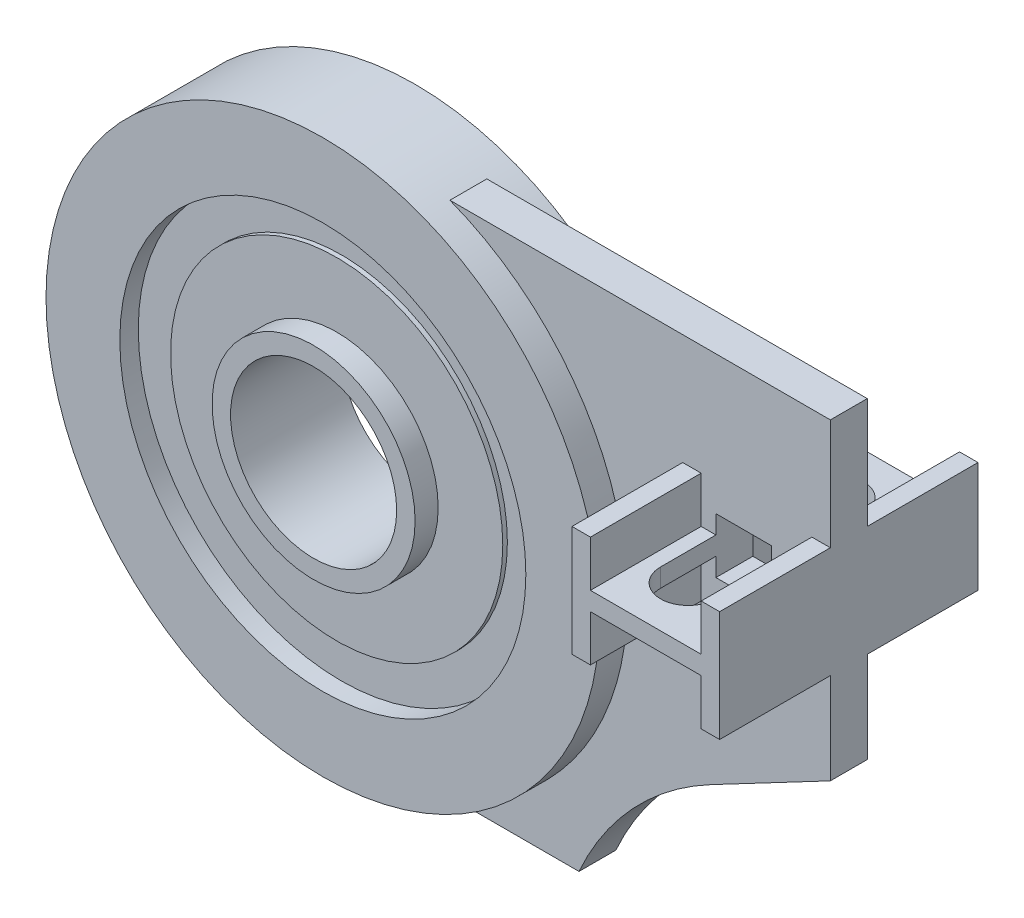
ISO-10303-21;
HEADER;
FILE_DESCRIPTION(('STEP AP214'),'2;1');
FILE_NAME('part.step','',(''),(''),'','','');
FILE_SCHEMA(('AUTOMOTIVE_DESIGN { 1 0 10303 214 1 1 1 1 }'));
ENDSEC;
DATA;
#1=APPLICATION_CONTEXT('core data for automotive mechanical design processes');
#2=APPLICATION_PROTOCOL_DEFINITION('international standard','automotive_design',2000,#1);
#3=PRODUCT_CONTEXT('',#1,'mechanical');
#4=PRODUCT('Part','Part','',(#3));
#5=PRODUCT_RELATED_PRODUCT_CATEGORY('part','',(#4));
#6=PRODUCT_DEFINITION_FORMATION('','',#4);
#7=PRODUCT_DEFINITION_CONTEXT('part definition',#1,'design');
#8=PRODUCT_DEFINITION('design','',#6,#7);
#9=PRODUCT_DEFINITION_SHAPE('','',#8);
#10=(LENGTH_UNIT() NAMED_UNIT(*) SI_UNIT(.MILLI.,.METRE.));
#11=(NAMED_UNIT(*) PLANE_ANGLE_UNIT() SI_UNIT($,.RADIAN.));
#12=(NAMED_UNIT(*) SI_UNIT($,.STERADIAN.) SOLID_ANGLE_UNIT());
#13=UNCERTAINTY_MEASURE_WITH_UNIT(LENGTH_MEASURE(1.E-05),#10,'distance_accuracy_value','');
#14=(GEOMETRIC_REPRESENTATION_CONTEXT(3) GLOBAL_UNCERTAINTY_ASSIGNED_CONTEXT((#13)) GLOBAL_UNIT_ASSIGNED_CONTEXT((#10,
#11,#12)) REPRESENTATION_CONTEXT('',''));
#15=CARTESIAN_POINT('',(0.,0.,0.));
#16=DIRECTION('',(0.,0.,1.));
#17=DIRECTION('',(1.,0.,0.));
#18=AXIS2_PLACEMENT_3D('',#15,#16,#17);
#19=CARTESIAN_POINT('',(0.,0.,-1.));
#20=DIRECTION('',(0.,0.,1.));
#21=DIRECTION('',(1.,0.,0.));
#22=AXIS2_PLACEMENT_3D('',#19,#20,#21);
#23=PLANE('',#22);
#24=DIRECTION('',(0.,-1.,0.));
#25=VECTOR('',#24,1.);
#26=CARTESIAN_POINT('',(22.8,0.,-1.));
#27=LINE('',#26,#25);
#28=CARTESIAN_POINT('',(22.8,6.5,-1.));
#29=VERTEX_POINT('',#28);
#30=CARTESIAN_POINT('',(22.8,5.5,-1.));
#31=VERTEX_POINT('',#30);
#32=EDGE_CURVE('E461',#29,#31,#27,.T.);
#33=ORIENTED_EDGE('',*,*,#32,.F.);
#34=DIRECTION('',(-1.,0.,0.));
#35=VECTOR('',#34,1.);
#36=CARTESIAN_POINT('',(0.,6.5,-1.));
#37=LINE('',#36,#35);
#38=CARTESIAN_POINT('',(19.8,6.5,-1.));
#39=VERTEX_POINT('',#38);
#40=EDGE_CURVE('E465',#29,#39,#37,.T.);
#41=ORIENTED_EDGE('',*,*,#40,.T.);
#42=DIRECTION('',(0.,1.,0.));
#43=VECTOR('',#42,1.);
#44=CARTESIAN_POINT('',(19.8,0.,-1.));
#45=LINE('',#44,#43);
#46=CARTESIAN_POINT('',(19.8,5.5,-1.));
#47=VERTEX_POINT('',#46);
#48=EDGE_CURVE('E453',#47,#39,#45,.T.);
#49=ORIENTED_EDGE('',*,*,#48,.F.);
#50=DIRECTION('',(1.,0.,0.));
#51=VECTOR('',#50,1.);
#52=CARTESIAN_POINT('',(25.,5.5,-1.));
#53=LINE('',#52,#51);
#54=CARTESIAN_POINT('',(19.,5.5,-1.));
#55=VERTEX_POINT('',#54);
#56=EDGE_CURVE('E469',#55,#47,#53,.T.);
#57=ORIENTED_EDGE('',*,*,#56,.F.);
#58=DIRECTION('',(0.,-1.,0.));
#59=VECTOR('',#58,1.);
#60=CARTESIAN_POINT('',(19.,8.,-1.));
#61=LINE('',#60,#59);
#62=CARTESIAN_POINT('',(19.,8.,-1.));
#63=VERTEX_POINT('',#62);
#64=EDGE_CURVE('E500',#63,#55,#61,.T.);
#65=ORIENTED_EDGE('',*,*,#64,.F.);
#66=DIRECTION('',(1.,0.,0.));
#67=VECTOR('',#66,1.);
#68=CARTESIAN_POINT('',(19.,8.,-1.));
#69=LINE('',#68,#67);
#70=CARTESIAN_POINT('',(18.,8.,-1.));
#71=VERTEX_POINT('',#70);
#72=EDGE_CURVE('E497',#71,#63,#69,.T.);
#73=ORIENTED_EDGE('',*,*,#72,.F.);
#74=DIRECTION('',(0.,1.,0.));
#75=VECTOR('',#74,1.);
#76=CARTESIAN_POINT('',(18.,8.,-1.));
#77=LINE('',#76,#75);
#78=CARTESIAN_POINT('',(18.,2.,-1.));
#79=VERTEX_POINT('',#78);
#80=EDGE_CURVE('E494',#79,#71,#77,.T.);
#81=ORIENTED_EDGE('',*,*,#80,.F.);
#82=DIRECTION('',(-1.,0.,0.));
#83=VECTOR('',#82,1.);
#84=CARTESIAN_POINT('',(19.,2.,-1.));
#85=LINE('',#84,#83);
#86=CARTESIAN_POINT('',(19.,2.,-1.));
#87=VERTEX_POINT('',#86);
#88=EDGE_CURVE('E491',#87,#79,#85,.T.);
#89=ORIENTED_EDGE('',*,*,#88,.F.);
#90=DIRECTION('',(0.,-1.,0.));
#91=VECTOR('',#90,1.);
#92=CARTESIAN_POINT('',(19.,4.5,-1.));
#93=LINE('',#92,#91);
#94=CARTESIAN_POINT('',(19.,4.5,-1.));
#95=VERTEX_POINT('',#94);
#96=EDGE_CURVE('E488',#95,#87,#93,.T.);
#97=ORIENTED_EDGE('',*,*,#96,.F.);
#98=DIRECTION('',(-1.,0.,0.));
#99=VECTOR('',#98,1.);
#100=CARTESIAN_POINT('',(25.,4.5,-1.));
#101=LINE('',#100,#99);
#102=CARTESIAN_POINT('',(19.8,4.5,-1.));
#103=VERTEX_POINT('',#102);
#104=EDGE_CURVE('E484',#103,#95,#101,.T.);
#105=ORIENTED_EDGE('',*,*,#104,.F.);
#106=CARTESIAN_POINT('',(19.8,3.5,-1.));
#107=VERTEX_POINT('',#106);
#108=EDGE_CURVE('E450',#107,#103,#45,.T.);
#109=ORIENTED_EDGE('',*,*,#108,.F.);
#110=DIRECTION('',(-1.,0.,0.));
#111=VECTOR('',#110,1.);
#112=CARTESIAN_POINT('',(0.,3.5,-1.));
#113=LINE('',#112,#111);
#114=CARTESIAN_POINT('',(22.8,3.5,-1.));
#115=VERTEX_POINT('',#114);
#116=EDGE_CURVE('E463',#115,#107,#113,.T.);
#117=ORIENTED_EDGE('',*,*,#116,.F.);
#118=CARTESIAN_POINT('',(22.8,4.5,-1.));
#119=VERTEX_POINT('',#118);
#120=EDGE_CURVE('E458',#119,#115,#27,.T.);
#121=ORIENTED_EDGE('',*,*,#120,.F.);
#122=CARTESIAN_POINT('',(25.,4.5,-1.));
#123=VERTEX_POINT('',#122);
#124=EDGE_CURVE('E485',#123,#119,#101,.T.);
#125=ORIENTED_EDGE('',*,*,#124,.F.);
#126=DIRECTION('',(0.,1.,0.));
#127=VECTOR('',#126,1.);
#128=CARTESIAN_POINT('',(25.,4.5,-1.));
#129=LINE('',#128,#127);
#130=CARTESIAN_POINT('',(25.,2.,-1.));
#131=VERTEX_POINT('',#130);
#132=EDGE_CURVE('E481',#131,#123,#129,.T.);
#133=ORIENTED_EDGE('',*,*,#132,.F.);
#134=DIRECTION('',(-1.,0.,0.));
#135=VECTOR('',#134,1.);
#136=CARTESIAN_POINT('',(26.,2.,-1.));
#137=LINE('',#136,#135);
#138=CARTESIAN_POINT('',(26.,2.,-1.));
#139=VERTEX_POINT('',#138);
#140=EDGE_CURVE('E478',#139,#131,#137,.T.);
#141=ORIENTED_EDGE('',*,*,#140,.F.);
#142=DIRECTION('',(0.,1.,0.));
#143=VECTOR('',#142,1.);
#144=CARTESIAN_POINT('',(26.,14.,-1.));
#145=LINE('',#144,#143);
#146=CARTESIAN_POINT('',(26.,-2.94003107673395,-1.));
#147=VERTEX_POINT('',#146);
#148=EDGE_CURVE('E575',#147,#139,#145,.T.);
#149=ORIENTED_EDGE('',*,*,#148,.F.);
#150=DIRECTION('',(0.884606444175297,0.466338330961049,0.));
#151=VECTOR('',#150,1.);
#152=CARTESIAN_POINT('',(26.,-2.94003107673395,-1.));
#153=LINE('',#152,#151);
#154=CARTESIAN_POINT('',(19.5385867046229,-6.34629689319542,-1.));
#155=VERTEX_POINT('',#154);
#156=EDGE_CURVE('E572',#155,#147,#153,.T.);
#157=ORIENTED_EDGE('',*,*,#156,.F.);
#158=CARTESIAN_POINT('',(27.,-20.5,-1.));
#159=DIRECTION('',(0.,0.,-1.));
#160=DIRECTION('',(1.,0.,0.));
#161=AXIS2_PLACEMENT_3D('',#158,#159,#160);
#162=CIRCLE('',#161,16.);
#163=CARTESIAN_POINT('',(12.3798084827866,-14.,-1.));
#164=VERTEX_POINT('',#163);
#165=EDGE_CURVE('E569',#164,#155,#162,.T.);
#166=ORIENTED_EDGE('',*,*,#165,.F.);
#167=DIRECTION('',(1.,0.,0.));
#168=VECTOR('',#167,1.);
#169=CARTESIAN_POINT('',(5.3851648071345,-14.,-1.));
#170=LINE('',#169,#168);
#171=CARTESIAN_POINT('',(5.3851648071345,-14.,-1.));
#172=VERTEX_POINT('',#171);
#173=EDGE_CURVE('E566',#172,#164,#170,.T.);
#174=ORIENTED_EDGE('',*,*,#173,.F.);
#175=CARTESIAN_POINT('',(0.,0.,-1.));
#176=DIRECTION('',(0.,0.,-1.));
#177=DIRECTION('',(1.,0.,0.));
#178=AXIS2_PLACEMENT_3D('',#175,#176,#177);
#179=CIRCLE('',#178,15.);
#180=CARTESIAN_POINT('',(5.3851648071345,14.,-1.));
#181=VERTEX_POINT('',#180);
#182=EDGE_CURVE('E564',#181,#172,#179,.T.);
#183=ORIENTED_EDGE('',*,*,#182,.F.);
#184=DIRECTION('',(-1.,0.,0.));
#185=VECTOR('',#184,1.);
#186=CARTESIAN_POINT('',(5.3851648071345,14.,-1.));
#187=LINE('',#186,#185);
#188=CARTESIAN_POINT('',(26.,14.,-1.));
#189=VERTEX_POINT('',#188);
#190=EDGE_CURVE('E578',#189,#181,#187,.T.);
#191=ORIENTED_EDGE('',*,*,#190,.F.);
#192=CARTESIAN_POINT('',(26.,8.,-1.));
#193=VERTEX_POINT('',#192);
#194=EDGE_CURVE('E574',#193,#189,#145,.T.);
#195=ORIENTED_EDGE('',*,*,#194,.F.);
#196=DIRECTION('',(1.,0.,0.));
#197=VECTOR('',#196,1.);
#198=CARTESIAN_POINT('',(26.,8.,-1.));
#199=LINE('',#198,#197);
#200=CARTESIAN_POINT('',(25.,8.,-1.));
#201=VERTEX_POINT('',#200);
#202=EDGE_CURVE('E475',#201,#193,#199,.T.);
#203=ORIENTED_EDGE('',*,*,#202,.F.);
#204=DIRECTION('',(0.,1.,0.));
#205=VECTOR('',#204,1.);
#206=CARTESIAN_POINT('',(25.,8.,-1.));
#207=LINE('',#206,#205);
#208=CARTESIAN_POINT('',(25.,5.5,-1.));
#209=VERTEX_POINT('',#208);
#210=EDGE_CURVE('E472',#209,#201,#207,.T.);
#211=ORIENTED_EDGE('',*,*,#210,.F.);
#212=EDGE_CURVE('E468',#31,#209,#53,.T.);
#213=ORIENTED_EDGE('',*,*,#212,.F.);
#214=EDGE_LOOP('',(#33,#41,#49,#57,#65,#73,#81,#89,#97,#105,#109,#117,#121,#125,#133,#141,#149,
#157,#166,#174,#183,#191,#195,#203,#211,#213));
#215=FACE_BOUND('',#214,.T.);
#216=ADVANCED_FACE('F31',(#215),#23,.F.);
#217=CARTESIAN_POINT('',(25.,5.5,-7.));
#218=DIRECTION('',(0.,-1.,0.));
#219=DIRECTION('',(0.,0.,-1.));
#220=AXIS2_PLACEMENT_3D('',#217,#218,#219);
#221=PLANE('',#220);
#222=DIRECTION('',(0.,0.,-1.));
#223=VECTOR('',#222,1.);
#224=CARTESIAN_POINT('',(22.8,5.5,-7.));
#225=LINE('',#224,#223);
#226=CARTESIAN_POINT('',(22.8,5.5,-4.));
#227=VERTEX_POINT('',#226);
#228=EDGE_CURVE('E460',#31,#227,#225,.T.);
#229=ORIENTED_EDGE('',*,*,#228,.F.);
#230=ORIENTED_EDGE('',*,*,#212,.T.);
#231=DIRECTION('',(0.,0.,1.));
#232=VECTOR('',#231,1.);
#233=CARTESIAN_POINT('',(25.,5.5,-7.));
#234=LINE('',#233,#232);
#235=CARTESIAN_POINT('',(25.,5.5,-7.));
#236=VERTEX_POINT('',#235);
#237=EDGE_CURVE('E561',#236,#209,#234,.T.);
#238=ORIENTED_EDGE('',*,*,#237,.F.);
#239=DIRECTION('',(1.,0.,0.));
#240=VECTOR('',#239,1.);
#241=CARTESIAN_POINT('',(25.,5.5,-7.));
#242=LINE('',#241,#240);
#243=CARTESIAN_POINT('',(19.,5.5,-7.));
#244=VERTEX_POINT('',#243);
#245=EDGE_CURVE('E503',#244,#236,#242,.T.);
#246=ORIENTED_EDGE('',*,*,#245,.F.);
#247=DIRECTION('',(0.,0.,1.));
#248=VECTOR('',#247,1.);
#249=CARTESIAN_POINT('',(19.,5.5,-7.));
#250=LINE('',#249,#248);
#251=EDGE_CURVE('E528',#244,#55,#250,.T.);
#252=ORIENTED_EDGE('',*,*,#251,.T.);
#253=ORIENTED_EDGE('',*,*,#56,.T.);
#254=DIRECTION('',(0.,0.,1.));
#255=VECTOR('',#254,1.);
#256=CARTESIAN_POINT('',(19.8,5.5,-7.));
#257=LINE('',#256,#255);
#258=CARTESIAN_POINT('',(19.8,5.5,-4.));
#259=VERTEX_POINT('',#258);
#260=EDGE_CURVE('E452',#259,#47,#257,.T.);
#261=ORIENTED_EDGE('',*,*,#260,.F.);
#262=CARTESIAN_POINT('',(21.3,5.5,-4.));
#263=DIRECTION('',(0.,-1.,0.));
#264=DIRECTION('',(0.,0.,-1.));
#265=AXIS2_PLACEMENT_3D('',#262,#263,#264);
#266=CIRCLE('',#265,1.5);
#267=EDGE_CURVE('E455',#227,#259,#266,.F.);
#268=ORIENTED_EDGE('',*,*,#267,.F.);
#269=EDGE_LOOP('',(#229,#230,#238,#246,#252,#253,#261,#268));
#270=FACE_BOUND('',#269,.T.);
#271=ADVANCED_FACE('F727',(#270),#221,.F.);
#272=CARTESIAN_POINT('',(25.,4.5,-7.));
#273=DIRECTION('',(0.,1.,0.));
#274=DIRECTION('',(0.,0.,1.));
#275=AXIS2_PLACEMENT_3D('',#272,#273,#274);
#276=PLANE('',#275);
#277=DIRECTION('',(0.,0.,1.));
#278=VECTOR('',#277,1.);
#279=CARTESIAN_POINT('',(22.8,4.5,-7.));
#280=LINE('',#279,#278);
#281=CARTESIAN_POINT('',(22.8,4.5,-4.));
#282=VERTEX_POINT('',#281);
#283=EDGE_CURVE('E39',#282,#119,#280,.T.);
#284=ORIENTED_EDGE('',*,*,#283,.F.);
#285=CARTESIAN_POINT('',(21.3,4.5,-4.));
#286=DIRECTION('',(0.,1.,0.));
#287=DIRECTION('',(0.,0.,1.));
#288=AXIS2_PLACEMENT_3D('',#285,#286,#287);
#289=CIRCLE('',#288,1.5);
#290=CARTESIAN_POINT('',(19.8,4.5,-4.));
#291=VERTEX_POINT('',#290);
#292=EDGE_CURVE('E663',#291,#282,#289,.F.);
#293=ORIENTED_EDGE('',*,*,#292,.F.);
#294=DIRECTION('',(0.,0.,-1.));
#295=VECTOR('',#294,1.);
#296=CARTESIAN_POINT('',(19.8,4.5,-7.));
#297=LINE('',#296,#295);
#298=EDGE_CURVE('E661',#103,#291,#297,.T.);
#299=ORIENTED_EDGE('',*,*,#298,.F.);
#300=ORIENTED_EDGE('',*,*,#104,.T.);
#301=DIRECTION('',(0.,0.,1.));
#302=VECTOR('',#301,1.);
#303=CARTESIAN_POINT('',(19.,4.5,-7.));
#304=LINE('',#303,#302);
#305=CARTESIAN_POINT('',(19.,4.5,-7.));
#306=VERTEX_POINT('',#305);
#307=EDGE_CURVE('E543',#306,#95,#304,.T.);
#308=ORIENTED_EDGE('',*,*,#307,.F.);
#309=DIRECTION('',(-1.,0.,0.));
#310=VECTOR('',#309,1.);
#311=CARTESIAN_POINT('',(25.,4.5,-7.));
#312=LINE('',#311,#310);
#313=CARTESIAN_POINT('',(25.,4.5,-7.));
#314=VERTEX_POINT('',#313);
#315=EDGE_CURVE('E516',#314,#306,#312,.T.);
#316=ORIENTED_EDGE('',*,*,#315,.F.);
#317=DIRECTION('',(0.,0.,1.));
#318=VECTOR('',#317,1.);
#319=CARTESIAN_POINT('',(25.,4.5,-7.));
#320=LINE('',#319,#318);
#321=EDGE_CURVE('E546',#314,#123,#320,.T.);
#322=ORIENTED_EDGE('',*,*,#321,.T.);
#323=ORIENTED_EDGE('',*,*,#124,.T.);
#324=EDGE_LOOP('',(#284,#293,#299,#300,#308,#316,#322,#323));
#325=FACE_BOUND('',#324,.T.);
#326=ADVANCED_FACE('F674',(#325),#276,.F.);
#327=CARTESIAN_POINT('',(0.,0.,2.5));
#328=DIRECTION('',(0.,0.,-1.));
#329=DIRECTION('',(-1.,0.,0.));
#330=AXIS2_PLACEMENT_3D('',#327,#328,#329);
#331=CYLINDRICAL_SURFACE('',#330,11.);
#332=CARTESIAN_POINT('',(0.,0.,-2.5));
#333=DIRECTION('',(0.,0.,1.));
#334=DIRECTION('',(1.,0.,0.));
#335=AXIS2_PLACEMENT_3D('',#332,#333,#334);
#336=CIRCLE('',#335,11.);
#337=CARTESIAN_POINT('',(11.,0.,-2.5));
#338=VERTEX_POINT('',#337);
#339=EDGE_CURVE('E646',#338,#338,#336,.T.);
#340=ORIENTED_EDGE('',*,*,#339,.F.);
#341=EDGE_LOOP('',(#340));
#342=FACE_BOUND('',#341,.T.);
#343=CARTESIAN_POINT('',(0.,0.,-1.5));
#344=DIRECTION('',(0.,0.,1.));
#345=DIRECTION('',(1.,0.,0.));
#346=AXIS2_PLACEMENT_3D('',#343,#344,#345);
#347=CIRCLE('',#346,11.);
#348=CARTESIAN_POINT('',(11.,0.,-1.5));
#349=VERTEX_POINT('',#348);
#350=EDGE_CURVE('E643',#349,#349,#347,.T.);
#351=ORIENTED_EDGE('',*,*,#350,.T.);
#352=EDGE_LOOP('',(#351));
#353=FACE_BOUND('',#352,.T.);
#354=ADVANCED_FACE('F830',(#342,#353),#331,.F.);
#355=CARTESIAN_POINT('',(0.,0.,2.5));
#356=DIRECTION('',(0.,0.,1.));
#357=DIRECTION('',(1.,0.,0.));
#358=AXIS2_PLACEMENT_3D('',#355,#356,#357);
#359=PLANE('',#358);
#360=CARTESIAN_POINT('',(0.,0.,2.5));
#361=DIRECTION('',(0.,0.,1.));
#362=DIRECTION('',(1.,0.,0.));
#363=AXIS2_PLACEMENT_3D('',#360,#361,#362);
#364=CIRCLE('',#363,15.);
#365=CARTESIAN_POINT('',(15.,0.,2.5));
#366=VERTEX_POINT('',#365);
#367=EDGE_CURVE('E655',#366,#366,#364,.T.);
#368=ORIENTED_EDGE('',*,*,#367,.T.);
#369=EDGE_LOOP('',(#368));
#370=FACE_BOUND('',#369,.T.);
#371=CARTESIAN_POINT('',(0.,0.,2.5));
#372=DIRECTION('',(0.,0.,1.));
#373=DIRECTION('',(1.,0.,0.));
#374=AXIS2_PLACEMENT_3D('',#371,#372,#373);
#375=CIRCLE('',#374,11.);
#376=CARTESIAN_POINT('',(11.,0.,2.5));
#377=VERTEX_POINT('',#376);
#378=EDGE_CURVE('E649',#377,#377,#375,.T.);
#379=ORIENTED_EDGE('',*,*,#378,.F.);
#380=EDGE_LOOP('',(#379));
#381=FACE_BOUND('',#380,.T.);
#382=ADVANCED_FACE('F833',(#370,#381),#359,.T.);
#383=CARTESIAN_POINT('',(0.,0.,-2.5));
#384=DIRECTION('',(0.,0.,1.));
#385=DIRECTION('',(1.,0.,0.));
#386=AXIS2_PLACEMENT_3D('',#383,#384,#385);
#387=PLANE('',#386);
#388=CARTESIAN_POINT('',(0.,0.,-2.5));
#389=DIRECTION('',(0.,0.,1.));
#390=DIRECTION('',(1.,0.,0.));
#391=AXIS2_PLACEMENT_3D('',#388,#389,#390);
#392=CIRCLE('',#391,15.);
#393=CARTESIAN_POINT('',(15.,0.,-2.5));
#394=VERTEX_POINT('',#393);
#395=EDGE_CURVE('E652',#394,#394,#392,.T.);
#396=ORIENTED_EDGE('',*,*,#395,.F.);
#397=EDGE_LOOP('',(#396));
#398=FACE_BOUND('',#397,.T.);
#399=ORIENTED_EDGE('',*,*,#339,.T.);
#400=EDGE_LOOP('',(#399));
#401=FACE_BOUND('',#400,.T.);
#402=ADVANCED_FACE('F831',(#398,#401),#387,.F.);
#403=CARTESIAN_POINT('',(0.,0.,2.5));
#404=DIRECTION('',(0.,0.,-1.));
#405=DIRECTION('',(-1.,0.,0.));
#406=AXIS2_PLACEMENT_3D('',#403,#404,#405);
#407=CYLINDRICAL_SURFACE('',#406,15.);
#408=DIRECTION('',(0.,0.,-1.));
#409=VECTOR('',#408,1.);
#410=CARTESIAN_POINT('',(5.3851648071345,-14.,1.));
#411=LINE('',#410,#409);
#412=CARTESIAN_POINT('',(5.3851648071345,-14.,1.));
#413=VERTEX_POINT('',#412);
#414=EDGE_CURVE('E610',#413,#172,#411,.T.);
#415=ORIENTED_EDGE('',*,*,#414,.F.);
#416=CARTESIAN_POINT('',(0.,0.,1.));
#417=DIRECTION('',(0.,0.,-1.));
#418=DIRECTION('',(1.,0.,0.));
#419=AXIS2_PLACEMENT_3D('',#416,#417,#418);
#420=CIRCLE('',#419,15.);
#421=CARTESIAN_POINT('',(5.3851648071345,14.,1.));
#422=VERTEX_POINT('',#421);
#423=EDGE_CURVE('E581',#422,#413,#420,.T.);
#424=ORIENTED_EDGE('',*,*,#423,.F.);
#425=DIRECTION('',(0.,0.,-1.));
#426=VECTOR('',#425,1.);
#427=CARTESIAN_POINT('',(5.3851648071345,14.,1.));
#428=LINE('',#427,#426);
#429=EDGE_CURVE('E596',#422,#181,#428,.T.);
#430=ORIENTED_EDGE('',*,*,#429,.T.);
#431=ORIENTED_EDGE('',*,*,#182,.T.);
#432=EDGE_LOOP('',(#415,#424,#430,#431));
#433=FACE_BOUND('',#432,.T.);
#434=ORIENTED_EDGE('',*,*,#367,.F.);
#435=EDGE_LOOP('',(#434));
#436=FACE_BOUND('',#435,.T.);
#437=ORIENTED_EDGE('',*,*,#395,.T.);
#438=EDGE_LOOP('',(#437));
#439=FACE_BOUND('',#438,.T.);
#440=ADVANCED_FACE('F33',(#433,#436,#439),#407,.T.);
#441=CARTESIAN_POINT('',(0.,0.,1.5));
#442=DIRECTION('',(0.,0.,1.));
#443=DIRECTION('',(1.,0.,0.));
#444=AXIS2_PLACEMENT_3D('',#441,#442,#443);
#445=CIRCLE('',#444,11.);
#446=CARTESIAN_POINT('',(11.,0.,1.5));
#447=VERTEX_POINT('',#446);
#448=EDGE_CURVE('E658',#447,#447,#445,.T.);
#449=ORIENTED_EDGE('',*,*,#448,.F.);
#450=EDGE_LOOP('',(#449));
#451=FACE_BOUND('',#450,.T.);
#452=ORIENTED_EDGE('',*,*,#378,.T.);
#453=EDGE_LOOP('',(#452));
#454=FACE_BOUND('',#453,.T.);
#455=ADVANCED_FACE('F825',(#451,#454),#331,.F.);
#456=CARTESIAN_POINT('',(0.,0.,1.5));
#457=DIRECTION('',(0.,0.,1.));
#458=DIRECTION('',(1.,0.,0.));
#459=AXIS2_PLACEMENT_3D('',#456,#457,#458);
#460=PLANE('',#459);
#461=ORIENTED_EDGE('',*,*,#448,.T.);
#462=EDGE_LOOP('',(#461));
#463=FACE_BOUND('',#462,.T.);
#464=CARTESIAN_POINT('',(0.,0.,1.5));
#465=DIRECTION('',(0.,0.,1.));
#466=DIRECTION('',(1.,0.,0.));
#467=AXIS2_PLACEMENT_3D('',#464,#465,#466);
#468=CIRCLE('',#467,9.);
#469=CARTESIAN_POINT('',(9.,0.,1.5));
#470=VERTEX_POINT('',#469);
#471=EDGE_CURVE('E640',#470,#470,#468,.T.);
#472=ORIENTED_EDGE('',*,*,#471,.F.);
#473=EDGE_LOOP('',(#472));
#474=FACE_BOUND('',#473,.T.);
#475=ADVANCED_FACE('F821',(#463,#474),#460,.T.);
#476=CARTESIAN_POINT('',(0.,0.,-1.5));
#477=DIRECTION('',(0.,0.,1.));
#478=DIRECTION('',(1.,0.,0.));
#479=AXIS2_PLACEMENT_3D('',#476,#477,#478);
#480=PLANE('',#479);
#481=ORIENTED_EDGE('',*,*,#350,.F.);
#482=EDGE_LOOP('',(#481));
#483=FACE_BOUND('',#482,.T.);
#484=CARTESIAN_POINT('',(0.,0.,-1.5));
#485=DIRECTION('',(0.,0.,1.));
#486=DIRECTION('',(1.,0.,0.));
#487=AXIS2_PLACEMENT_3D('',#484,#485,#486);
#488=CIRCLE('',#487,9.);
#489=CARTESIAN_POINT('',(9.,0.,-1.5));
#490=VERTEX_POINT('',#489);
#491=EDGE_CURVE('E637',#490,#490,#488,.F.);
#492=ORIENTED_EDGE('',*,*,#491,.F.);
#493=EDGE_LOOP('',(#492));
#494=FACE_BOUND('',#493,.T.);
#495=ADVANCED_FACE('F818',(#483,#494),#480,.F.);
#496=CARTESIAN_POINT('',(0.,0.,1.75));
#497=DIRECTION('',(0.,0.,-1.));
#498=DIRECTION('',(-1.,0.,0.));
#499=AXIS2_PLACEMENT_3D('',#496,#497,#498);
#500=CYLINDRICAL_SURFACE('',#499,9.);
#501=CARTESIAN_POINT('',(0.,0.,-1.75));
#502=DIRECTION('',(0.,0.,1.));
#503=DIRECTION('',(1.,0.,0.));
#504=AXIS2_PLACEMENT_3D('',#501,#502,#503);
#505=CIRCLE('',#504,9.);
#506=CARTESIAN_POINT('',(9.,0.,-1.75));
#507=VERTEX_POINT('',#506);
#508=EDGE_CURVE('E631',#507,#507,#505,.T.);
#509=ORIENTED_EDGE('',*,*,#508,.T.);
#510=EDGE_LOOP('',(#509));
#511=FACE_BOUND('',#510,.T.);
#512=ORIENTED_EDGE('',*,*,#491,.T.);
#513=EDGE_LOOP('',(#512));
#514=FACE_BOUND('',#513,.T.);
#515=ADVANCED_FACE('F813',(#511,#514),#500,.T.);
#516=CARTESIAN_POINT('',(0.,0.,1.75));
#517=DIRECTION('',(0.,0.,1.));
#518=DIRECTION('',(1.,0.,0.));
#519=AXIS2_PLACEMENT_3D('',#516,#517,#518);
#520=PLANE('',#519);
#521=CARTESIAN_POINT('',(0.,0.,1.75));
#522=DIRECTION('',(0.,0.,1.));
#523=DIRECTION('',(1.,0.,0.));
#524=AXIS2_PLACEMENT_3D('',#521,#522,#523);
#525=CIRCLE('',#524,9.);
#526=CARTESIAN_POINT('',(9.,0.,1.75));
#527=VERTEX_POINT('',#526);
#528=EDGE_CURVE('E634',#527,#527,#525,.T.);
#529=ORIENTED_EDGE('',*,*,#528,.T.);
#530=EDGE_LOOP('',(#529));
#531=FACE_BOUND('',#530,.T.);
#532=CARTESIAN_POINT('',(0.,0.,1.75));
#533=DIRECTION('',(0.,0.,1.));
#534=DIRECTION('',(1.,0.,0.));
#535=AXIS2_PLACEMENT_3D('',#532,#533,#534);
#536=CIRCLE('',#535,5.5);
#537=CARTESIAN_POINT('',(5.5,0.,1.75));
#538=VERTEX_POINT('',#537);
#539=EDGE_CURVE('E628',#538,#538,#536,.T.);
#540=ORIENTED_EDGE('',*,*,#539,.F.);
#541=EDGE_LOOP('',(#540));
#542=FACE_BOUND('',#541,.T.);
#543=ADVANCED_FACE('F809',(#531,#542),#520,.T.);
#544=CARTESIAN_POINT('',(0.,0.,-1.75));
#545=DIRECTION('',(0.,0.,1.));
#546=DIRECTION('',(1.,0.,0.));
#547=AXIS2_PLACEMENT_3D('',#544,#545,#546);
#548=PLANE('',#547);
#549=ORIENTED_EDGE('',*,*,#508,.F.);
#550=EDGE_LOOP('',(#549));
#551=FACE_BOUND('',#550,.T.);
#552=CARTESIAN_POINT('',(0.,0.,-1.75));
#553=DIRECTION('',(0.,0.,1.));
#554=DIRECTION('',(1.,0.,0.));
#555=AXIS2_PLACEMENT_3D('',#552,#553,#554);
#556=CIRCLE('',#555,5.5);
#557=CARTESIAN_POINT('',(5.5,0.,-1.75));
#558=VERTEX_POINT('',#557);
#559=EDGE_CURVE('E625',#558,#558,#556,.F.);
#560=ORIENTED_EDGE('',*,*,#559,.F.);
#561=EDGE_LOOP('',(#560));
#562=FACE_BOUND('',#561,.T.);
#563=ADVANCED_FACE('F805',(#551,#562),#548,.F.);
#564=ORIENTED_EDGE('',*,*,#471,.T.);
#565=EDGE_LOOP('',(#564));
#566=FACE_BOUND('',#565,.T.);
#567=ORIENTED_EDGE('',*,*,#528,.F.);
#568=EDGE_LOOP('',(#567));
#569=FACE_BOUND('',#568,.T.);
#570=ADVANCED_FACE('F808',(#566,#569),#500,.T.);
#571=CARTESIAN_POINT('',(0.,0.,3.));
#572=DIRECTION('',(0.,0.,-1.));
#573=DIRECTION('',(-1.,0.,0.));
#574=AXIS2_PLACEMENT_3D('',#571,#572,#573);
#575=CYLINDRICAL_SURFACE('',#574,5.5);
#576=CARTESIAN_POINT('',(0.,0.,-3.));
#577=DIRECTION('',(0.,0.,1.));
#578=DIRECTION('',(1.,0.,0.));
#579=AXIS2_PLACEMENT_3D('',#576,#577,#578);
#580=CIRCLE('',#579,5.5);
#581=CARTESIAN_POINT('',(5.5,0.,-3.));
#582=VERTEX_POINT('',#581);
#583=EDGE_CURVE('E619',#582,#582,#580,.T.);
#584=ORIENTED_EDGE('',*,*,#583,.T.);
#585=EDGE_LOOP('',(#584));
#586=FACE_BOUND('',#585,.T.);
#587=ORIENTED_EDGE('',*,*,#559,.T.);
#588=EDGE_LOOP('',(#587));
#589=FACE_BOUND('',#588,.T.);
#590=ADVANCED_FACE('F800',(#586,#589),#575,.T.);
#591=CARTESIAN_POINT('',(0.,0.,3.));
#592=DIRECTION('',(0.,0.,1.));
#593=DIRECTION('',(1.,0.,0.));
#594=AXIS2_PLACEMENT_3D('',#591,#592,#593);
#595=PLANE('',#594);
#596=CARTESIAN_POINT('',(0.,0.,3.));
#597=DIRECTION('',(0.,0.,1.));
#598=DIRECTION('',(1.,0.,0.));
#599=AXIS2_PLACEMENT_3D('',#596,#597,#598);
#600=CIRCLE('',#599,5.5);
#601=CARTESIAN_POINT('',(5.5,0.,3.));
#602=VERTEX_POINT('',#601);
#603=EDGE_CURVE('E622',#602,#602,#600,.T.);
#604=ORIENTED_EDGE('',*,*,#603,.T.);
#605=EDGE_LOOP('',(#604));
#606=FACE_BOUND('',#605,.T.);
#607=CARTESIAN_POINT('',(0.,0.,3.));
#608=DIRECTION('',(0.,0.,1.));
#609=DIRECTION('',(1.,0.,0.));
#610=AXIS2_PLACEMENT_3D('',#607,#608,#609);
#611=CIRCLE('',#610,4.5);
#612=CARTESIAN_POINT('',(4.5,0.,3.));
#613=VERTEX_POINT('',#612);
#614=EDGE_CURVE('E616',#613,#613,#611,.T.);
#615=ORIENTED_EDGE('',*,*,#614,.F.);
#616=EDGE_LOOP('',(#615));
#617=FACE_BOUND('',#616,.T.);
#618=ADVANCED_FACE('F796',(#606,#617),#595,.T.);
#619=CARTESIAN_POINT('',(0.,0.,-3.));
#620=DIRECTION('',(0.,0.,1.));
#621=DIRECTION('',(1.,0.,0.));
#622=AXIS2_PLACEMENT_3D('',#619,#620,#621);
#623=PLANE('',#622);
#624=ORIENTED_EDGE('',*,*,#583,.F.);
#625=EDGE_LOOP('',(#624));
#626=FACE_BOUND('',#625,.T.);
#627=CARTESIAN_POINT('',(0.,0.,-3.));
#628=DIRECTION('',(0.,0.,1.));
#629=DIRECTION('',(1.,0.,0.));
#630=AXIS2_PLACEMENT_3D('',#627,#628,#629);
#631=CIRCLE('',#630,4.5);
#632=CARTESIAN_POINT('',(4.5,0.,-3.));
#633=VERTEX_POINT('',#632);
#634=EDGE_CURVE('E613',#633,#633,#631,.T.);
#635=ORIENTED_EDGE('',*,*,#634,.T.);
#636=EDGE_LOOP('',(#635));
#637=FACE_BOUND('',#636,.T.);
#638=ADVANCED_FACE('F793',(#626,#637),#623,.F.);
#639=ORIENTED_EDGE('',*,*,#539,.T.);
#640=EDGE_LOOP('',(#639));
#641=FACE_BOUND('',#640,.T.);
#642=ORIENTED_EDGE('',*,*,#603,.F.);
#643=EDGE_LOOP('',(#642));
#644=FACE_BOUND('',#643,.T.);
#645=ADVANCED_FACE('F791',(#641,#644),#575,.T.);
#646=CARTESIAN_POINT('',(0.,0.,3.));
#647=DIRECTION('',(0.,0.,-1.));
#648=DIRECTION('',(-1.,0.,0.));
#649=AXIS2_PLACEMENT_3D('',#646,#647,#648);
#650=CYLINDRICAL_SURFACE('',#649,4.5);
#651=ORIENTED_EDGE('',*,*,#614,.T.);
#652=EDGE_LOOP('',(#651));
#653=FACE_BOUND('',#652,.T.);
#654=ORIENTED_EDGE('',*,*,#634,.F.);
#655=EDGE_LOOP('',(#654));
#656=FACE_BOUND('',#655,.T.);
#657=ADVANCED_FACE('F788',(#653,#656),#650,.F.);
#658=CARTESIAN_POINT('',(5.3851648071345,-14.,1.));
#659=DIRECTION('',(0.,1.,0.));
#660=DIRECTION('',(0.,0.,1.));
#661=AXIS2_PLACEMENT_3D('',#658,#659,#660);
#662=PLANE('',#661);
#663=ORIENTED_EDGE('',*,*,#173,.T.);
#664=DIRECTION('',(0.,0.,-1.));
#665=VECTOR('',#664,1.);
#666=CARTESIAN_POINT('',(12.3798084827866,-14.,1.));
#667=LINE('',#666,#665);
#668=CARTESIAN_POINT('',(12.3798084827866,-14.,1.));
#669=VERTEX_POINT('',#668);
#670=EDGE_CURVE('E607',#669,#164,#667,.T.);
#671=ORIENTED_EDGE('',*,*,#670,.F.);
#672=DIRECTION('',(1.,0.,0.));
#673=VECTOR('',#672,1.);
#674=CARTESIAN_POINT('',(5.3851648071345,-14.,1.));
#675=LINE('',#674,#673);
#676=EDGE_CURVE('E584',#413,#669,#675,.T.);
#677=ORIENTED_EDGE('',*,*,#676,.F.);
#678=ORIENTED_EDGE('',*,*,#414,.T.);
#679=EDGE_LOOP('',(#663,#671,#677,#678));
#680=FACE_BOUND('',#679,.T.);
#681=ADVANCED_FACE('F704',(#680),#662,.F.);
#682=CARTESIAN_POINT('',(27.,-20.5,1.));
#683=DIRECTION('',(0.,0.,-1.));
#684=DIRECTION('',(-1.,0.,0.));
#685=AXIS2_PLACEMENT_3D('',#682,#683,#684);
#686=CYLINDRICAL_SURFACE('',#685,16.);
#687=ORIENTED_EDGE('',*,*,#165,.T.);
#688=DIRECTION('',(0.,0.,-1.));
#689=VECTOR('',#688,1.);
#690=CARTESIAN_POINT('',(19.5385867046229,-6.34629689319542,1.));
#691=LINE('',#690,#689);
#692=CARTESIAN_POINT('',(19.5385867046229,-6.34629689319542,1.));
#693=VERTEX_POINT('',#692);
#694=EDGE_CURVE('E604',#693,#155,#691,.T.);
#695=ORIENTED_EDGE('',*,*,#694,.F.);
#696=CARTESIAN_POINT('',(27.,-20.5,1.));
#697=DIRECTION('',(0.,0.,-1.));
#698=DIRECTION('',(1.,0.,0.));
#699=AXIS2_PLACEMENT_3D('',#696,#697,#698);
#700=CIRCLE('',#699,16.);
#701=EDGE_CURVE('E586',#669,#693,#700,.T.);
#702=ORIENTED_EDGE('',*,*,#701,.F.);
#703=ORIENTED_EDGE('',*,*,#670,.T.);
#704=EDGE_LOOP('',(#687,#695,#702,#703));
#705=FACE_BOUND('',#704,.T.);
#706=ADVANCED_FACE('F696',(#705),#686,.F.);
#707=CARTESIAN_POINT('',(26.,-2.94003107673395,1.));
#708=DIRECTION('',(-0.466338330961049,0.884606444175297,0.));
#709=DIRECTION('',(-0.884606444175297,-0.466338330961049,0.));
#710=AXIS2_PLACEMENT_3D('',#707,#708,#709);
#711=PLANE('',#710);
#712=ORIENTED_EDGE('',*,*,#156,.T.);
#713=DIRECTION('',(0.,0.,-1.));
#714=VECTOR('',#713,1.);
#715=CARTESIAN_POINT('',(26.,-2.94003107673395,1.));
#716=LINE('',#715,#714);
#717=CARTESIAN_POINT('',(26.,-2.94003107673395,1.));
#718=VERTEX_POINT('',#717);
#719=EDGE_CURVE('E601',#718,#147,#716,.T.);
#720=ORIENTED_EDGE('',*,*,#719,.F.);
#721=DIRECTION('',(0.884606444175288,0.466338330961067,0.));
#722=VECTOR('',#721,1.);
#723=CARTESIAN_POINT('',(21.3342295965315,-5.39968711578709,1.));
#724=LINE('',#723,#722);
#725=EDGE_CURVE('E588',#693,#718,#724,.T.);
#726=ORIENTED_EDGE('',*,*,#725,.F.);
#727=ORIENTED_EDGE('',*,*,#694,.T.);
#728=EDGE_LOOP('',(#712,#720,#726,#727));
#729=FACE_BOUND('',#728,.T.);
#730=ADVANCED_FACE('F700',(#729),#711,.F.);
#731=CARTESIAN_POINT('',(26.,14.,1.));
#732=DIRECTION('',(-1.,0.,0.));
#733=DIRECTION('',(0.,0.,1.));
#734=AXIS2_PLACEMENT_3D('',#731,#732,#733);
#735=PLANE('',#734);
#736=ORIENTED_EDGE('',*,*,#148,.T.);
#737=DIRECTION('',(0.,0.,1.));
#738=VECTOR('',#737,1.);
#739=CARTESIAN_POINT('',(26.,2.,-7.));
#740=LINE('',#739,#738);
#741=CARTESIAN_POINT('',(26.,2.,-7.));
#742=VERTEX_POINT('',#741);
#743=EDGE_CURVE('E552',#742,#139,#740,.T.);
#744=ORIENTED_EDGE('',*,*,#743,.F.);
#745=DIRECTION('',(0.,-1.,0.));
#746=VECTOR('',#745,1.);
#747=CARTESIAN_POINT('',(26.,8.,-7.));
#748=LINE('',#747,#746);
#749=CARTESIAN_POINT('',(26.,8.,-7.));
#750=VERTEX_POINT('',#749);
#751=EDGE_CURVE('E510',#750,#742,#748,.T.);
#752=ORIENTED_EDGE('',*,*,#751,.F.);
#753=DIRECTION('',(0.,0.,1.));
#754=VECTOR('',#753,1.);
#755=CARTESIAN_POINT('',(26.,8.,-7.));
#756=LINE('',#755,#754);
#757=EDGE_CURVE('E555',#750,#193,#756,.T.);
#758=ORIENTED_EDGE('',*,*,#757,.T.);
#759=ORIENTED_EDGE('',*,*,#194,.T.);
#760=DIRECTION('',(0.,0.,-1.));
#761=VECTOR('',#760,1.);
#762=CARTESIAN_POINT('',(26.,14.,1.));
#763=LINE('',#762,#761);
#764=CARTESIAN_POINT('',(26.,14.,1.));
#765=VERTEX_POINT('',#764);
#766=EDGE_CURVE('E598',#765,#189,#763,.T.);
#767=ORIENTED_EDGE('',*,*,#766,.F.);
#768=DIRECTION('',(0.,1.,0.));
#769=VECTOR('',#768,1.);
#770=CARTESIAN_POINT('',(26.,14.,1.));
#771=LINE('',#770,#769);
#772=CARTESIAN_POINT('',(26.,8.,1.));
#773=VERTEX_POINT('',#772);
#774=EDGE_CURVE('E590',#773,#765,#771,.T.);
#775=ORIENTED_EDGE('',*,*,#774,.F.);
#776=DIRECTION('',(0.,0.,-1.));
#777=VECTOR('',#776,1.);
#778=CARTESIAN_POINT('',(26.,8.,7.));
#779=LINE('',#778,#777);
#780=CARTESIAN_POINT('',(26.,8.,7.));
#781=VERTEX_POINT('',#780);
#782=EDGE_CURVE('E398',#781,#773,#779,.T.);
#783=ORIENTED_EDGE('',*,*,#782,.F.);
#784=DIRECTION('',(0.,-1.,0.));
#785=VECTOR('',#784,1.);
#786=CARTESIAN_POINT('',(26.,8.,7.));
#787=LINE('',#786,#785);
#788=CARTESIAN_POINT('',(26.,2.,7.));
#789=VERTEX_POINT('',#788);
#790=EDGE_CURVE('E384',#781,#789,#787,.T.);
#791=ORIENTED_EDGE('',*,*,#790,.T.);
#792=DIRECTION('',(0.,0.,-1.));
#793=VECTOR('',#792,1.);
#794=CARTESIAN_POINT('',(26.,2.,7.));
#795=LINE('',#794,#793);
#796=CARTESIAN_POINT('',(26.,2.,1.));
#797=VERTEX_POINT('',#796);
#798=EDGE_CURVE('E401',#789,#797,#795,.T.);
#799=ORIENTED_EDGE('',*,*,#798,.T.);
#800=EDGE_CURVE('E591',#718,#797,#771,.T.);
#801=ORIENTED_EDGE('',*,*,#800,.F.);
#802=ORIENTED_EDGE('',*,*,#719,.T.);
#803=EDGE_LOOP('',(#736,#744,#752,#758,#759,#767,#775,#783,#791,#799,#801,#802));
#804=FACE_BOUND('',#803,.T.);
#805=ADVANCED_FACE('F689',(#804),#735,.F.);
#806=CARTESIAN_POINT('',(5.3851648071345,14.,1.));
#807=DIRECTION('',(0.,-1.,0.));
#808=DIRECTION('',(0.,0.,-1.));
#809=AXIS2_PLACEMENT_3D('',#806,#807,#808);
#810=PLANE('',#809);
#811=ORIENTED_EDGE('',*,*,#190,.T.);
#812=ORIENTED_EDGE('',*,*,#429,.F.);
#813=DIRECTION('',(-1.,0.,0.));
#814=VECTOR('',#813,1.);
#815=CARTESIAN_POINT('',(5.3851648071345,14.,1.));
#816=LINE('',#815,#814);
#817=EDGE_CURVE('E593',#765,#422,#816,.T.);
#818=ORIENTED_EDGE('',*,*,#817,.F.);
#819=ORIENTED_EDGE('',*,*,#766,.T.);
#820=EDGE_LOOP('',(#811,#812,#818,#819));
#821=FACE_BOUND('',#820,.T.);
#822=ADVANCED_FACE('F712',(#821),#810,.F.);
#823=CARTESIAN_POINT('',(0.,0.,1.));
#824=DIRECTION('',(0.,0.,1.));
#825=DIRECTION('',(1.,0.,0.));
#826=AXIS2_PLACEMENT_3D('',#823,#824,#825);
#827=PLANE('',#826);
#828=DIRECTION('',(1.,0.,0.));
#829=VECTOR('',#828,1.);
#830=CARTESIAN_POINT('',(25.,5.5,1.));
#831=LINE('',#830,#829);
#832=CARTESIAN_POINT('',(19.,5.5,1.));
#833=VERTEX_POINT('',#832);
#834=CARTESIAN_POINT('',(19.8,5.5,1.));
#835=VERTEX_POINT('',#834);
#836=EDGE_CURVE('E330',#833,#835,#831,.T.);
#837=ORIENTED_EDGE('',*,*,#836,.T.);
#838=DIRECTION('',(0.,-1.,0.));
#839=VECTOR('',#838,1.);
#840=CARTESIAN_POINT('',(19.8,6.5,1.));
#841=LINE('',#840,#839);
#842=CARTESIAN_POINT('',(19.8,6.5,1.));
#843=VERTEX_POINT('',#842);
#844=EDGE_CURVE('E438',#843,#835,#841,.T.);
#845=ORIENTED_EDGE('',*,*,#844,.F.);
#846=DIRECTION('',(1.,0.,0.));
#847=VECTOR('',#846,1.);
#848=CARTESIAN_POINT('',(19.8,6.5,1.));
#849=LINE('',#848,#847);
#850=CARTESIAN_POINT('',(22.8,6.5,1.));
#851=VERTEX_POINT('',#850);
#852=EDGE_CURVE('E429',#843,#851,#849,.T.);
#853=ORIENTED_EDGE('',*,*,#852,.T.);
#854=DIRECTION('',(0.,-1.,0.));
#855=VECTOR('',#854,1.);
#856=CARTESIAN_POINT('',(22.8,6.5,1.));
#857=LINE('',#856,#855);
#858=CARTESIAN_POINT('',(22.8,5.5,1.));
#859=VERTEX_POINT('',#858);
#860=EDGE_CURVE('E448',#851,#859,#857,.T.);
#861=ORIENTED_EDGE('',*,*,#860,.T.);
#862=CARTESIAN_POINT('',(25.,5.5,1.));
#863=VERTEX_POINT('',#862);
#864=EDGE_CURVE('E309',#859,#863,#831,.T.);
#865=ORIENTED_EDGE('',*,*,#864,.T.);
#866=DIRECTION('',(0.,1.,0.));
#867=VECTOR('',#866,1.);
#868=CARTESIAN_POINT('',(25.,8.,1.));
#869=LINE('',#868,#867);
#870=CARTESIAN_POINT('',(25.,8.,1.));
#871=VERTEX_POINT('',#870);
#872=EDGE_CURVE('E355',#863,#871,#869,.T.);
#873=ORIENTED_EDGE('',*,*,#872,.T.);
#874=DIRECTION('',(1.,0.,0.));
#875=VECTOR('',#874,1.);
#876=CARTESIAN_POINT('',(26.,8.,1.));
#877=LINE('',#876,#875);
#878=EDGE_CURVE('E353',#871,#773,#877,.T.);
#879=ORIENTED_EDGE('',*,*,#878,.T.);
#880=ORIENTED_EDGE('',*,*,#774,.T.);
#881=ORIENTED_EDGE('',*,*,#817,.T.);
#882=ORIENTED_EDGE('',*,*,#423,.T.);
#883=ORIENTED_EDGE('',*,*,#676,.T.);
#884=ORIENTED_EDGE('',*,*,#701,.T.);
#885=ORIENTED_EDGE('',*,*,#725,.T.);
#886=ORIENTED_EDGE('',*,*,#800,.T.);
#887=DIRECTION('',(-1.,0.,0.));
#888=VECTOR('',#887,1.);
#889=CARTESIAN_POINT('',(26.,2.,1.));
#890=LINE('',#889,#888);
#891=CARTESIAN_POINT('',(25.,2.,1.));
#892=VERTEX_POINT('',#891);
#893=EDGE_CURVE('E51',#797,#892,#890,.T.);
#894=ORIENTED_EDGE('',*,*,#893,.T.);
#895=DIRECTION('',(0.,1.,0.));
#896=VECTOR('',#895,1.);
#897=CARTESIAN_POINT('',(25.,4.5,1.));
#898=LINE('',#897,#896);
#899=CARTESIAN_POINT('',(25.,4.5,1.));
#900=VERTEX_POINT('',#899);
#901=EDGE_CURVE('E46',#892,#900,#898,.T.);
#902=ORIENTED_EDGE('',*,*,#901,.T.);
#903=DIRECTION('',(-1.,0.,0.));
#904=VECTOR('',#903,1.);
#905=CARTESIAN_POINT('',(25.,4.5,1.));
#906=LINE('',#905,#904);
#907=CARTESIAN_POINT('',(22.8,4.5,1.));
#908=VERTEX_POINT('',#907);
#909=EDGE_CURVE('E349',#900,#908,#906,.T.);
#910=ORIENTED_EDGE('',*,*,#909,.T.);
#911=CARTESIAN_POINT('',(22.8,3.5,1.));
#912=VERTEX_POINT('',#911);
#913=EDGE_CURVE('E447',#908,#912,#857,.T.);
#914=ORIENTED_EDGE('',*,*,#913,.T.);
#915=DIRECTION('',(1.,0.,0.));
#916=VECTOR('',#915,1.);
#917=CARTESIAN_POINT('',(19.8,3.5,1.));
#918=LINE('',#917,#916);
#919=CARTESIAN_POINT('',(19.8,3.5,1.));
#920=VERTEX_POINT('',#919);
#921=EDGE_CURVE('E420',#920,#912,#918,.T.);
#922=ORIENTED_EDGE('',*,*,#921,.F.);
#923=CARTESIAN_POINT('',(19.8,4.5,1.));
#924=VERTEX_POINT('',#923);
#925=EDGE_CURVE('E437',#924,#920,#841,.T.);
#926=ORIENTED_EDGE('',*,*,#925,.F.);
#927=CARTESIAN_POINT('',(19.,4.5,1.));
#928=VERTEX_POINT('',#927);
#929=EDGE_CURVE('E348',#924,#928,#906,.T.);
#930=ORIENTED_EDGE('',*,*,#929,.T.);
#931=DIRECTION('',(0.,-1.,0.));
#932=VECTOR('',#931,1.);
#933=CARTESIAN_POINT('',(19.,4.5,1.));
#934=LINE('',#933,#932);
#935=CARTESIAN_POINT('',(19.,2.,1.));
#936=VERTEX_POINT('',#935);
#937=EDGE_CURVE('E345',#928,#936,#934,.T.);
#938=ORIENTED_EDGE('',*,*,#937,.T.);
#939=DIRECTION('',(-1.,0.,0.));
#940=VECTOR('',#939,1.);
#941=CARTESIAN_POINT('',(19.,2.,1.));
#942=LINE('',#941,#940);
#943=CARTESIAN_POINT('',(18.,2.,1.));
#944=VERTEX_POINT('',#943);
#945=EDGE_CURVE('E342',#936,#944,#942,.T.);
#946=ORIENTED_EDGE('',*,*,#945,.T.);
#947=DIRECTION('',(0.,1.,0.));
#948=VECTOR('',#947,1.);
#949=CARTESIAN_POINT('',(18.,8.,1.));
#950=LINE('',#949,#948);
#951=CARTESIAN_POINT('',(18.,8.,1.));
#952=VERTEX_POINT('',#951);
#953=EDGE_CURVE('E339',#944,#952,#950,.T.);
#954=ORIENTED_EDGE('',*,*,#953,.T.);
#955=DIRECTION('',(1.,0.,0.));
#956=VECTOR('',#955,1.);
#957=CARTESIAN_POINT('',(19.,8.,1.));
#958=LINE('',#957,#956);
#959=CARTESIAN_POINT('',(19.,8.,1.));
#960=VERTEX_POINT('',#959);
#961=EDGE_CURVE('E336',#952,#960,#958,.T.);
#962=ORIENTED_EDGE('',*,*,#961,.T.);
#963=DIRECTION('',(0.,-1.,0.));
#964=VECTOR('',#963,1.);
#965=CARTESIAN_POINT('',(19.,8.,1.));
#966=LINE('',#965,#964);
#967=EDGE_CURVE('E333',#960,#833,#966,.T.);
#968=ORIENTED_EDGE('',*,*,#967,.T.);
#969=EDGE_LOOP('',(#837,#845,#853,#861,#865,#873,#879,#880,#881,#882,#883,#884,#885,#886,#894,
#902,#910,#914,#922,#926,#930,#938,#946,#954,#962,#968));
#970=FACE_BOUND('',#969,.T.);
#971=ADVANCED_FACE('F701',(#970),#827,.T.);
#972=CARTESIAN_POINT('',(25.,8.,-7.));
#973=DIRECTION('',(1.,0.,0.));
#974=DIRECTION('',(0.,0.,-1.));
#975=AXIS2_PLACEMENT_3D('',#972,#973,#974);
#976=PLANE('',#975);
#977=ORIENTED_EDGE('',*,*,#210,.T.);
#978=DIRECTION('',(0.,0.,1.));
#979=VECTOR('',#978,1.);
#980=CARTESIAN_POINT('',(25.,8.,-7.));
#981=LINE('',#980,#979);
#982=CARTESIAN_POINT('',(25.,8.,-7.));
#983=VERTEX_POINT('',#982);
#984=EDGE_CURVE('E558',#983,#201,#981,.T.);
#985=ORIENTED_EDGE('',*,*,#984,.F.);
#986=DIRECTION('',(0.,1.,0.));
#987=VECTOR('',#986,1.);
#988=CARTESIAN_POINT('',(25.,8.,-7.));
#989=LINE('',#988,#987);
#990=EDGE_CURVE('E506',#236,#983,#989,.T.);
#991=ORIENTED_EDGE('',*,*,#990,.F.);
#992=ORIENTED_EDGE('',*,*,#237,.T.);
#993=EDGE_LOOP('',(#977,#985,#991,#992));
#994=FACE_BOUND('',#993,.T.);
#995=ADVANCED_FACE('F722',(#994),#976,.F.);
#996=CARTESIAN_POINT('',(26.,8.,-7.));
#997=DIRECTION('',(0.,-1.,0.));
#998=DIRECTION('',(0.,0.,-1.));
#999=AXIS2_PLACEMENT_3D('',#996,#997,#998);
#1000=PLANE('',#999);
#1001=ORIENTED_EDGE('',*,*,#202,.T.);
#1002=ORIENTED_EDGE('',*,*,#757,.F.);
#1003=DIRECTION('',(1.,0.,0.));
#1004=VECTOR('',#1003,1.);
#1005=CARTESIAN_POINT('',(26.,8.,-7.));
#1006=LINE('',#1005,#1004);
#1007=EDGE_CURVE('E508',#983,#750,#1006,.T.);
#1008=ORIENTED_EDGE('',*,*,#1007,.F.);
#1009=ORIENTED_EDGE('',*,*,#984,.T.);
#1010=EDGE_LOOP('',(#1001,#1002,#1008,#1009));
#1011=FACE_BOUND('',#1010,.T.);
#1012=ADVANCED_FACE('F718',(#1011),#1000,.F.);
#1013=CARTESIAN_POINT('',(26.,2.,-7.));
#1014=DIRECTION('',(0.,1.,0.));
#1015=DIRECTION('',(0.,0.,1.));
#1016=AXIS2_PLACEMENT_3D('',#1013,#1014,#1015);
#1017=PLANE('',#1016);
#1018=ORIENTED_EDGE('',*,*,#140,.T.);
#1019=DIRECTION('',(0.,0.,1.));
#1020=VECTOR('',#1019,1.);
#1021=CARTESIAN_POINT('',(25.,2.,-7.));
#1022=LINE('',#1021,#1020);
#1023=CARTESIAN_POINT('',(25.,2.,-7.));
#1024=VERTEX_POINT('',#1023);
#1025=EDGE_CURVE('E549',#1024,#131,#1022,.T.);
#1026=ORIENTED_EDGE('',*,*,#1025,.F.);
#1027=DIRECTION('',(-1.,0.,0.));
#1028=VECTOR('',#1027,1.);
#1029=CARTESIAN_POINT('',(26.,2.,-7.));
#1030=LINE('',#1029,#1028);
#1031=EDGE_CURVE('E512',#742,#1024,#1030,.T.);
#1032=ORIENTED_EDGE('',*,*,#1031,.F.);
#1033=ORIENTED_EDGE('',*,*,#743,.T.);
#1034=EDGE_LOOP('',(#1018,#1026,#1032,#1033));
#1035=FACE_BOUND('',#1034,.T.);
#1036=ADVANCED_FACE('F684',(#1035),#1017,.F.);
#1037=CARTESIAN_POINT('',(25.,4.5,-7.));
#1038=DIRECTION('',(1.,0.,0.));
#1039=DIRECTION('',(0.,0.,-1.));
#1040=AXIS2_PLACEMENT_3D('',#1037,#1038,#1039);
#1041=PLANE('',#1040);
#1042=ORIENTED_EDGE('',*,*,#132,.T.);
#1043=ORIENTED_EDGE('',*,*,#321,.F.);
#1044=DIRECTION('',(0.,1.,0.));
#1045=VECTOR('',#1044,1.);
#1046=CARTESIAN_POINT('',(25.,4.5,-7.));
#1047=LINE('',#1046,#1045);
#1048=EDGE_CURVE('E514',#1024,#314,#1047,.T.);
#1049=ORIENTED_EDGE('',*,*,#1048,.F.);
#1050=ORIENTED_EDGE('',*,*,#1025,.T.);
#1051=EDGE_LOOP('',(#1042,#1043,#1049,#1050));
#1052=FACE_BOUND('',#1051,.T.);
#1053=ADVANCED_FACE('F680',(#1052),#1041,.F.);
#1054=CARTESIAN_POINT('',(19.,4.5,-7.));
#1055=DIRECTION('',(-1.,0.,0.));
#1056=DIRECTION('',(0.,0.,1.));
#1057=AXIS2_PLACEMENT_3D('',#1054,#1055,#1056);
#1058=PLANE('',#1057);
#1059=ORIENTED_EDGE('',*,*,#96,.T.);
#1060=DIRECTION('',(0.,0.,1.));
#1061=VECTOR('',#1060,1.);
#1062=CARTESIAN_POINT('',(19.,2.,-7.));
#1063=LINE('',#1062,#1061);
#1064=CARTESIAN_POINT('',(19.,2.,-7.));
#1065=VERTEX_POINT('',#1064);
#1066=EDGE_CURVE('E540',#1065,#87,#1063,.T.);
#1067=ORIENTED_EDGE('',*,*,#1066,.F.);
#1068=DIRECTION('',(0.,-1.,0.));
#1069=VECTOR('',#1068,1.);
#1070=CARTESIAN_POINT('',(19.,4.5,-7.));
#1071=LINE('',#1070,#1069);
#1072=EDGE_CURVE('E518',#306,#1065,#1071,.T.);
#1073=ORIENTED_EDGE('',*,*,#1072,.F.);
#1074=ORIENTED_EDGE('',*,*,#307,.T.);
#1075=EDGE_LOOP('',(#1059,#1067,#1073,#1074));
#1076=FACE_BOUND('',#1075,.T.);
#1077=ADVANCED_FACE('F740',(#1076),#1058,.F.);
#1078=CARTESIAN_POINT('',(19.,2.,-7.));
#1079=DIRECTION('',(0.,1.,0.));
#1080=DIRECTION('',(0.,0.,1.));
#1081=AXIS2_PLACEMENT_3D('',#1078,#1079,#1080);
#1082=PLANE('',#1081);
#1083=ORIENTED_EDGE('',*,*,#88,.T.);
#1084=DIRECTION('',(0.,0.,1.));
#1085=VECTOR('',#1084,1.);
#1086=CARTESIAN_POINT('',(18.,2.,-7.));
#1087=LINE('',#1086,#1085);
#1088=CARTESIAN_POINT('',(18.,2.,-7.));
#1089=VERTEX_POINT('',#1088);
#1090=EDGE_CURVE('E537',#1089,#79,#1087,.T.);
#1091=ORIENTED_EDGE('',*,*,#1090,.F.);
#1092=DIRECTION('',(-1.,0.,0.));
#1093=VECTOR('',#1092,1.);
#1094=CARTESIAN_POINT('',(19.,2.,-7.));
#1095=LINE('',#1094,#1093);
#1096=EDGE_CURVE('E520',#1065,#1089,#1095,.T.);
#1097=ORIENTED_EDGE('',*,*,#1096,.F.);
#1098=ORIENTED_EDGE('',*,*,#1066,.T.);
#1099=EDGE_LOOP('',(#1083,#1091,#1097,#1098));
#1100=FACE_BOUND('',#1099,.T.);
#1101=ADVANCED_FACE('F759',(#1100),#1082,.F.);
#1102=CARTESIAN_POINT('',(18.,8.,-7.));
#1103=DIRECTION('',(1.,0.,0.));
#1104=DIRECTION('',(0.,0.,-1.));
#1105=AXIS2_PLACEMENT_3D('',#1102,#1103,#1104);
#1106=PLANE('',#1105);
#1107=ORIENTED_EDGE('',*,*,#80,.T.);
#1108=DIRECTION('',(0.,0.,1.));
#1109=VECTOR('',#1108,1.);
#1110=CARTESIAN_POINT('',(18.,8.,-7.));
#1111=LINE('',#1110,#1109);
#1112=CARTESIAN_POINT('',(18.,8.,-7.));
#1113=VERTEX_POINT('',#1112);
#1114=EDGE_CURVE('E534',#1113,#71,#1111,.T.);
#1115=ORIENTED_EDGE('',*,*,#1114,.F.);
#1116=DIRECTION('',(0.,1.,0.));
#1117=VECTOR('',#1116,1.);
#1118=CARTESIAN_POINT('',(18.,8.,-7.));
#1119=LINE('',#1118,#1117);
#1120=EDGE_CURVE('E522',#1089,#1113,#1119,.T.);
#1121=ORIENTED_EDGE('',*,*,#1120,.F.);
#1122=ORIENTED_EDGE('',*,*,#1090,.T.);
#1123=EDGE_LOOP('',(#1107,#1115,#1121,#1122));
#1124=FACE_BOUND('',#1123,.T.);
#1125=ADVANCED_FACE('F757',(#1124),#1106,.F.);
#1126=CARTESIAN_POINT('',(19.,8.,-7.));
#1127=DIRECTION('',(0.,-1.,0.));
#1128=DIRECTION('',(0.,0.,-1.));
#1129=AXIS2_PLACEMENT_3D('',#1126,#1127,#1128);
#1130=PLANE('',#1129);
#1131=ORIENTED_EDGE('',*,*,#72,.T.);
#1132=DIRECTION('',(0.,0.,1.));
#1133=VECTOR('',#1132,1.);
#1134=CARTESIAN_POINT('',(19.,8.,-7.));
#1135=LINE('',#1134,#1133);
#1136=CARTESIAN_POINT('',(19.,8.,-7.));
#1137=VERTEX_POINT('',#1136);
#1138=EDGE_CURVE('E531',#1137,#63,#1135,.T.);
#1139=ORIENTED_EDGE('',*,*,#1138,.F.);
#1140=DIRECTION('',(1.,0.,0.));
#1141=VECTOR('',#1140,1.);
#1142=CARTESIAN_POINT('',(19.,8.,-7.));
#1143=LINE('',#1142,#1141);
#1144=EDGE_CURVE('E524',#1113,#1137,#1143,.T.);
#1145=ORIENTED_EDGE('',*,*,#1144,.F.);
#1146=ORIENTED_EDGE('',*,*,#1114,.T.);
#1147=EDGE_LOOP('',(#1131,#1139,#1145,#1146));
#1148=FACE_BOUND('',#1147,.T.);
#1149=ADVANCED_FACE('F752',(#1148),#1130,.F.);
#1150=CARTESIAN_POINT('',(19.,8.,-7.));
#1151=DIRECTION('',(-1.,0.,0.));
#1152=DIRECTION('',(0.,0.,1.));
#1153=AXIS2_PLACEMENT_3D('',#1150,#1151,#1152);
#1154=PLANE('',#1153);
#1155=ORIENTED_EDGE('',*,*,#64,.T.);
#1156=ORIENTED_EDGE('',*,*,#251,.F.);
#1157=DIRECTION('',(0.,-1.,0.));
#1158=VECTOR('',#1157,1.);
#1159=CARTESIAN_POINT('',(19.,8.,-7.));
#1160=LINE('',#1159,#1158);
#1161=EDGE_CURVE('E526',#1137,#244,#1160,.T.);
#1162=ORIENTED_EDGE('',*,*,#1161,.F.);
#1163=ORIENTED_EDGE('',*,*,#1138,.T.);
#1164=EDGE_LOOP('',(#1155,#1156,#1162,#1163));
#1165=FACE_BOUND('',#1164,.T.);
#1166=ADVANCED_FACE('F748',(#1165),#1154,.F.);
#1167=CARTESIAN_POINT('',(19.,5.5,-7.));
#1168=DIRECTION('',(0.,0.,1.));
#1169=DIRECTION('',(1.,0.,0.));
#1170=AXIS2_PLACEMENT_3D('',#1167,#1168,#1169);
#1171=PLANE('',#1170);
#1172=ORIENTED_EDGE('',*,*,#245,.T.);
#1173=ORIENTED_EDGE('',*,*,#990,.T.);
#1174=ORIENTED_EDGE('',*,*,#1007,.T.);
#1175=ORIENTED_EDGE('',*,*,#751,.T.);
#1176=ORIENTED_EDGE('',*,*,#1031,.T.);
#1177=ORIENTED_EDGE('',*,*,#1048,.T.);
#1178=ORIENTED_EDGE('',*,*,#315,.T.);
#1179=ORIENTED_EDGE('',*,*,#1072,.T.);
#1180=ORIENTED_EDGE('',*,*,#1096,.T.);
#1181=ORIENTED_EDGE('',*,*,#1120,.T.);
#1182=ORIENTED_EDGE('',*,*,#1144,.T.);
#1183=ORIENTED_EDGE('',*,*,#1161,.T.);
#1184=EDGE_LOOP('',(#1172,#1173,#1174,#1175,#1176,#1177,#1178,#1179,#1180,#1181,#1182,#1183));
#1185=FACE_BOUND('',#1184,.T.);
#1186=ADVANCED_FACE('F743',(#1185),#1171,.F.);
#1187=CARTESIAN_POINT('',(21.3,6.5,-4.));
#1188=DIRECTION('',(0.,1.,0.));
#1189=DIRECTION('',(0.,0.,1.));
#1190=AXIS2_PLACEMENT_3D('',#1187,#1188,#1189);
#1191=PLANE('',#1190);
#1192=DIRECTION('',(0.,0.,-1.));
#1193=VECTOR('',#1192,1.);
#1194=CARTESIAN_POINT('',(22.8,6.5,1.));
#1195=LINE('',#1194,#1193);
#1196=EDGE_CURVE('E432',#851,#29,#1195,.T.);
#1197=ORIENTED_EDGE('',*,*,#1196,.F.);
#1198=ORIENTED_EDGE('',*,*,#852,.F.);
#1199=DIRECTION('',(0.,0.,1.));
#1200=VECTOR('',#1199,1.);
#1201=CARTESIAN_POINT('',(19.8,6.5,-4.));
#1202=LINE('',#1201,#1200);
#1203=EDGE_CURVE('E435',#39,#843,#1202,.T.);
#1204=ORIENTED_EDGE('',*,*,#1203,.F.);
#1205=ORIENTED_EDGE('',*,*,#40,.F.);
#1206=EDGE_LOOP('',(#1197,#1198,#1204,#1205));
#1207=FACE_BOUND('',#1206,.T.);
#1208=ADVANCED_FACE('F977',(#1207),#1191,.F.);
#1209=CARTESIAN_POINT('',(21.3,3.5,-4.));
#1210=DIRECTION('',(0.,1.,0.));
#1211=DIRECTION('',(0.,0.,1.));
#1212=AXIS2_PLACEMENT_3D('',#1209,#1210,#1211);
#1213=PLANE('',#1212);
#1214=ORIENTED_EDGE('',*,*,#116,.T.);
#1215=DIRECTION('',(0.,0.,1.));
#1216=VECTOR('',#1215,1.);
#1217=CARTESIAN_POINT('',(19.8,3.5,-4.));
#1218=LINE('',#1217,#1216);
#1219=EDGE_CURVE('E426',#107,#920,#1218,.T.);
#1220=ORIENTED_EDGE('',*,*,#1219,.T.);
#1221=ORIENTED_EDGE('',*,*,#921,.T.);
#1222=DIRECTION('',(0.,0.,-1.));
#1223=VECTOR('',#1222,1.);
#1224=CARTESIAN_POINT('',(22.8,3.5,1.));
#1225=LINE('',#1224,#1223);
#1226=EDGE_CURVE('E423',#912,#115,#1225,.T.);
#1227=ORIENTED_EDGE('',*,*,#1226,.T.);
#1228=EDGE_LOOP('',(#1214,#1220,#1221,#1227));
#1229=FACE_BOUND('',#1228,.T.);
#1230=ADVANCED_FACE('F1005',(#1229),#1213,.T.);
#1231=CARTESIAN_POINT('',(22.8,6.5,1.));
#1232=DIRECTION('',(-1.,0.,0.));
#1233=DIRECTION('',(0.,0.,1.));
#1234=AXIS2_PLACEMENT_3D('',#1231,#1232,#1233);
#1235=PLANE('',#1234);
#1236=ORIENTED_EDGE('',*,*,#283,.T.);
#1237=ORIENTED_EDGE('',*,*,#120,.T.);
#1238=ORIENTED_EDGE('',*,*,#1226,.F.);
#1239=ORIENTED_EDGE('',*,*,#913,.F.);
#1240=DIRECTION('',(0.,0.,1.));
#1241=VECTOR('',#1240,1.);
#1242=CARTESIAN_POINT('',(22.8,4.5,7.));
#1243=LINE('',#1242,#1241);
#1244=CARTESIAN_POINT('',(22.8,4.5,4.));
#1245=VERTEX_POINT('',#1244);
#1246=EDGE_CURVE('E318',#908,#1245,#1243,.T.);
#1247=ORIENTED_EDGE('',*,*,#1246,.T.);
#1248=DIRECTION('',(0.,-1.,0.));
#1249=VECTOR('',#1248,1.);
#1250=CARTESIAN_POINT('',(22.8,6.5,4.));
#1251=LINE('',#1250,#1249);
#1252=CARTESIAN_POINT('',(22.8,5.5,4.));
#1253=VERTEX_POINT('',#1252);
#1254=EDGE_CURVE('E303',#1253,#1245,#1251,.T.);
#1255=ORIENTED_EDGE('',*,*,#1254,.F.);
#1256=DIRECTION('',(0.,0.,-1.));
#1257=VECTOR('',#1256,1.);
#1258=CARTESIAN_POINT('',(22.8,5.5,7.));
#1259=LINE('',#1258,#1257);
#1260=EDGE_CURVE('E315',#1253,#859,#1259,.T.);
#1261=ORIENTED_EDGE('',*,*,#1260,.T.);
#1262=ORIENTED_EDGE('',*,*,#860,.F.);
#1263=ORIENTED_EDGE('',*,*,#1196,.T.);
#1264=ORIENTED_EDGE('',*,*,#32,.T.);
#1265=ORIENTED_EDGE('',*,*,#228,.T.);
#1266=DIRECTION('',(0.,-1.,0.));
#1267=VECTOR('',#1266,1.);
#1268=CARTESIAN_POINT('',(22.8,6.5,-4.));
#1269=LINE('',#1268,#1267);
#1270=EDGE_CURVE('E444',#227,#282,#1269,.T.);
#1271=ORIENTED_EDGE('',*,*,#1270,.T.);
#1272=EDGE_LOOP('',(#1236,#1237,#1238,#1239,#1247,#1255,#1261,#1262,#1263,#1264,#1265,#1271));
#1273=FACE_BOUND('',#1272,.T.);
#1274=ADVANCED_FACE('F313',(#1273),#1235,.T.);
#1275=CARTESIAN_POINT('',(21.3,6.5,-4.));
#1276=DIRECTION('',(0.,-1.,0.));
#1277=DIRECTION('',(0.,0.,-1.));
#1278=AXIS2_PLACEMENT_3D('',#1275,#1276,#1277);
#1279=CYLINDRICAL_SURFACE('',#1278,1.5);
#1280=ORIENTED_EDGE('',*,*,#267,.T.);
#1281=DIRECTION('',(0.,-1.,0.));
#1282=VECTOR('',#1281,1.);
#1283=CARTESIAN_POINT('',(19.8,6.5,-4.));
#1284=LINE('',#1283,#1282);
#1285=EDGE_CURVE('E441',#259,#291,#1284,.T.);
#1286=ORIENTED_EDGE('',*,*,#1285,.T.);
#1287=ORIENTED_EDGE('',*,*,#292,.T.);
#1288=ORIENTED_EDGE('',*,*,#1270,.F.);
#1289=EDGE_LOOP('',(#1280,#1286,#1287,#1288));
#1290=FACE_BOUND('',#1289,.T.);
#1291=ADVANCED_FACE('F732',(#1290),#1279,.F.);
#1292=CARTESIAN_POINT('',(19.8,6.5,-4.));
#1293=DIRECTION('',(1.,0.,0.));
#1294=DIRECTION('',(0.,0.,-1.));
#1295=AXIS2_PLACEMENT_3D('',#1292,#1293,#1294);
#1296=PLANE('',#1295);
#1297=ORIENTED_EDGE('',*,*,#260,.T.);
#1298=ORIENTED_EDGE('',*,*,#48,.T.);
#1299=ORIENTED_EDGE('',*,*,#1203,.T.);
#1300=ORIENTED_EDGE('',*,*,#844,.T.);
#1301=DIRECTION('',(0.,0.,1.));
#1302=VECTOR('',#1301,1.);
#1303=CARTESIAN_POINT('',(19.8,5.5,7.));
#1304=LINE('',#1303,#1302);
#1305=CARTESIAN_POINT('',(19.8,5.5,4.));
#1306=VERTEX_POINT('',#1305);
#1307=EDGE_CURVE('E310',#835,#1306,#1304,.T.);
#1308=ORIENTED_EDGE('',*,*,#1307,.T.);
#1309=DIRECTION('',(0.,-1.,0.));
#1310=VECTOR('',#1309,1.);
#1311=CARTESIAN_POINT('',(19.8,6.5,4.));
#1312=LINE('',#1311,#1310);
#1313=CARTESIAN_POINT('',(19.8,4.5,4.));
#1314=VERTEX_POINT('',#1313);
#1315=EDGE_CURVE('E306',#1306,#1314,#1312,.T.);
#1316=ORIENTED_EDGE('',*,*,#1315,.T.);
#1317=DIRECTION('',(0.,0.,-1.));
#1318=VECTOR('',#1317,1.);
#1319=CARTESIAN_POINT('',(19.8,4.5,7.));
#1320=LINE('',#1319,#1318);
#1321=EDGE_CURVE('E323',#1314,#924,#1320,.T.);
#1322=ORIENTED_EDGE('',*,*,#1321,.T.);
#1323=ORIENTED_EDGE('',*,*,#925,.T.);
#1324=ORIENTED_EDGE('',*,*,#1219,.F.);
#1325=ORIENTED_EDGE('',*,*,#108,.T.);
#1326=ORIENTED_EDGE('',*,*,#298,.T.);
#1327=ORIENTED_EDGE('',*,*,#1285,.F.);
#1328=EDGE_LOOP('',(#1297,#1298,#1299,#1300,#1308,#1316,#1322,#1323,#1324,#1325,#1326,#1327));
#1329=FACE_BOUND('',#1328,.T.);
#1330=ADVANCED_FACE('F1024',(#1329),#1296,.T.);
#1331=CARTESIAN_POINT('',(25.,5.5,7.));
#1332=DIRECTION('',(0.,1.,0.));
#1333=DIRECTION('',(0.,0.,1.));
#1334=AXIS2_PLACEMENT_3D('',#1331,#1332,#1333);
#1335=PLANE('',#1334);
#1336=ORIENTED_EDGE('',*,*,#1307,.F.);
#1337=ORIENTED_EDGE('',*,*,#836,.F.);
#1338=DIRECTION('',(0.,0.,-1.));
#1339=VECTOR('',#1338,1.);
#1340=CARTESIAN_POINT('',(19.,5.5,7.));
#1341=LINE('',#1340,#1339);
#1342=CARTESIAN_POINT('',(19.,5.5,7.));
#1343=VERTEX_POINT('',#1342);
#1344=EDGE_CURVE('E418',#1343,#833,#1341,.T.);
#1345=ORIENTED_EDGE('',*,*,#1344,.F.);
#1346=DIRECTION('',(1.,0.,0.));
#1347=VECTOR('',#1346,1.);
#1348=CARTESIAN_POINT('',(25.,5.5,7.));
#1349=LINE('',#1348,#1347);
#1350=CARTESIAN_POINT('',(25.,5.5,7.));
#1351=VERTEX_POINT('',#1350);
#1352=EDGE_CURVE('E357',#1343,#1351,#1349,.T.);
#1353=ORIENTED_EDGE('',*,*,#1352,.T.);
#1354=DIRECTION('',(0.,0.,-1.));
#1355=VECTOR('',#1354,1.);
#1356=CARTESIAN_POINT('',(25.,5.5,7.));
#1357=LINE('',#1356,#1355);
#1358=EDGE_CURVE('E393',#1351,#863,#1357,.T.);
#1359=ORIENTED_EDGE('',*,*,#1358,.T.);
#1360=ORIENTED_EDGE('',*,*,#864,.F.);
#1361=ORIENTED_EDGE('',*,*,#1260,.F.);
#1362=CARTESIAN_POINT('',(21.3,5.5,4.));
#1363=DIRECTION('',(0.,1.,0.));
#1364=DIRECTION('',(0.,0.,1.));
#1365=AXIS2_PLACEMENT_3D('',#1362,#1363,#1364);
#1366=CIRCLE('',#1365,1.5);
#1367=EDGE_CURVE('E300',#1306,#1253,#1366,.T.);
#1368=ORIENTED_EDGE('',*,*,#1367,.F.);
#1369=EDGE_LOOP('',(#1336,#1337,#1345,#1353,#1359,#1360,#1361,#1368));
#1370=FACE_BOUND('',#1369,.T.);
#1371=ADVANCED_FACE('F321',(#1370),#1335,.T.);
#1372=CARTESIAN_POINT('',(19.,8.,7.));
#1373=DIRECTION('',(1.,0.,0.));
#1374=DIRECTION('',(0.,0.,-1.));
#1375=AXIS2_PLACEMENT_3D('',#1372,#1373,#1374);
#1376=PLANE('',#1375);
#1377=ORIENTED_EDGE('',*,*,#967,.F.);
#1378=DIRECTION('',(0.,0.,-1.));
#1379=VECTOR('',#1378,1.);
#1380=CARTESIAN_POINT('',(19.,8.,7.));
#1381=LINE('',#1380,#1379);
#1382=CARTESIAN_POINT('',(19.,8.,7.));
#1383=VERTEX_POINT('',#1382);
#1384=EDGE_CURVE('E416',#1383,#960,#1381,.T.);
#1385=ORIENTED_EDGE('',*,*,#1384,.F.);
#1386=DIRECTION('',(0.,-1.,0.));
#1387=VECTOR('',#1386,1.);
#1388=CARTESIAN_POINT('',(19.,8.,7.));
#1389=LINE('',#1388,#1387);
#1390=EDGE_CURVE('E360',#1383,#1343,#1389,.T.);
#1391=ORIENTED_EDGE('',*,*,#1390,.T.);
#1392=ORIENTED_EDGE('',*,*,#1344,.T.);
#1393=EDGE_LOOP('',(#1377,#1385,#1391,#1392));
#1394=FACE_BOUND('',#1393,.T.);
#1395=ADVANCED_FACE('F1041',(#1394),#1376,.T.);
#1396=CARTESIAN_POINT('',(19.,8.,7.));
#1397=DIRECTION('',(0.,1.,0.));
#1398=DIRECTION('',(0.,0.,1.));
#1399=AXIS2_PLACEMENT_3D('',#1396,#1397,#1398);
#1400=PLANE('',#1399);
#1401=ORIENTED_EDGE('',*,*,#961,.F.);
#1402=DIRECTION('',(0.,0.,-1.));
#1403=VECTOR('',#1402,1.);
#1404=CARTESIAN_POINT('',(18.,8.,7.));
#1405=LINE('',#1404,#1403);
#1406=CARTESIAN_POINT('',(18.,8.,7.));
#1407=VERTEX_POINT('',#1406);
#1408=EDGE_CURVE('E414',#1407,#952,#1405,.T.);
#1409=ORIENTED_EDGE('',*,*,#1408,.F.);
#1410=DIRECTION('',(1.,0.,0.));
#1411=VECTOR('',#1410,1.);
#1412=CARTESIAN_POINT('',(19.,8.,7.));
#1413=LINE('',#1412,#1411);
#1414=EDGE_CURVE('E363',#1407,#1383,#1413,.T.);
#1415=ORIENTED_EDGE('',*,*,#1414,.T.);
#1416=ORIENTED_EDGE('',*,*,#1384,.T.);
#1417=EDGE_LOOP('',(#1401,#1409,#1415,#1416));
#1418=FACE_BOUND('',#1417,.T.);
#1419=ADVANCED_FACE('F1048',(#1418),#1400,.T.);
#1420=CARTESIAN_POINT('',(18.,8.,7.));
#1421=DIRECTION('',(-1.,0.,0.));
#1422=DIRECTION('',(0.,0.,1.));
#1423=AXIS2_PLACEMENT_3D('',#1420,#1421,#1422);
#1424=PLANE('',#1423);
#1425=ORIENTED_EDGE('',*,*,#953,.F.);
#1426=DIRECTION('',(0.,0.,-1.));
#1427=VECTOR('',#1426,1.);
#1428=CARTESIAN_POINT('',(18.,2.,7.));
#1429=LINE('',#1428,#1427);
#1430=CARTESIAN_POINT('',(18.,2.,7.));
#1431=VERTEX_POINT('',#1430);
#1432=EDGE_CURVE('E412',#1431,#944,#1429,.T.);
#1433=ORIENTED_EDGE('',*,*,#1432,.F.);
#1434=DIRECTION('',(0.,1.,0.));
#1435=VECTOR('',#1434,1.);
#1436=CARTESIAN_POINT('',(18.,8.,7.));
#1437=LINE('',#1436,#1435);
#1438=EDGE_CURVE('E366',#1431,#1407,#1437,.T.);
#1439=ORIENTED_EDGE('',*,*,#1438,.T.);
#1440=ORIENTED_EDGE('',*,*,#1408,.T.);
#1441=EDGE_LOOP('',(#1425,#1433,#1439,#1440));
#1442=FACE_BOUND('',#1441,.T.);
#1443=ADVANCED_FACE('F1056',(#1442),#1424,.T.);
#1444=CARTESIAN_POINT('',(19.,2.,7.));
#1445=DIRECTION('',(0.,-1.,0.));
#1446=DIRECTION('',(0.,0.,-1.));
#1447=AXIS2_PLACEMENT_3D('',#1444,#1445,#1446);
#1448=PLANE('',#1447);
#1449=ORIENTED_EDGE('',*,*,#945,.F.);
#1450=DIRECTION('',(0.,0.,-1.));
#1451=VECTOR('',#1450,1.);
#1452=CARTESIAN_POINT('',(19.,2.,7.));
#1453=LINE('',#1452,#1451);
#1454=CARTESIAN_POINT('',(19.,2.,7.));
#1455=VERTEX_POINT('',#1454);
#1456=EDGE_CURVE('E410',#1455,#936,#1453,.T.);
#1457=ORIENTED_EDGE('',*,*,#1456,.F.);
#1458=DIRECTION('',(-1.,0.,0.));
#1459=VECTOR('',#1458,1.);
#1460=CARTESIAN_POINT('',(19.,2.,7.));
#1461=LINE('',#1460,#1459);
#1462=EDGE_CURVE('E369',#1455,#1431,#1461,.T.);
#1463=ORIENTED_EDGE('',*,*,#1462,.T.);
#1464=ORIENTED_EDGE('',*,*,#1432,.T.);
#1465=EDGE_LOOP('',(#1449,#1457,#1463,#1464));
#1466=FACE_BOUND('',#1465,.T.);
#1467=ADVANCED_FACE('F1064',(#1466),#1448,.T.);
#1468=CARTESIAN_POINT('',(19.,4.5,7.));
#1469=DIRECTION('',(1.,0.,0.));
#1470=DIRECTION('',(0.,0.,-1.));
#1471=AXIS2_PLACEMENT_3D('',#1468,#1469,#1470);
#1472=PLANE('',#1471);
#1473=ORIENTED_EDGE('',*,*,#937,.F.);
#1474=DIRECTION('',(0.,0.,-1.));
#1475=VECTOR('',#1474,1.);
#1476=CARTESIAN_POINT('',(19.,4.5,7.));
#1477=LINE('',#1476,#1475);
#1478=CARTESIAN_POINT('',(19.,4.5,7.));
#1479=VERTEX_POINT('',#1478);
#1480=EDGE_CURVE('E408',#1479,#928,#1477,.T.);
#1481=ORIENTED_EDGE('',*,*,#1480,.F.);
#1482=DIRECTION('',(0.,-1.,0.));
#1483=VECTOR('',#1482,1.);
#1484=CARTESIAN_POINT('',(19.,4.5,7.));
#1485=LINE('',#1484,#1483);
#1486=EDGE_CURVE('E372',#1479,#1455,#1485,.T.);
#1487=ORIENTED_EDGE('',*,*,#1486,.T.);
#1488=ORIENTED_EDGE('',*,*,#1456,.T.);
#1489=EDGE_LOOP('',(#1473,#1481,#1487,#1488));
#1490=FACE_BOUND('',#1489,.T.);
#1491=ADVANCED_FACE('F1072',(#1490),#1472,.T.);
#1492=CARTESIAN_POINT('',(25.,4.5,7.));
#1493=DIRECTION('',(0.,-1.,0.));
#1494=DIRECTION('',(0.,0.,-1.));
#1495=AXIS2_PLACEMENT_3D('',#1492,#1493,#1494);
#1496=PLANE('',#1495);
#1497=ORIENTED_EDGE('',*,*,#1321,.F.);
#1498=CARTESIAN_POINT('',(21.3,4.5,4.));
#1499=DIRECTION('',(0.,-1.,0.));
#1500=DIRECTION('',(0.,0.,-1.));
#1501=AXIS2_PLACEMENT_3D('',#1498,#1499,#1500);
#1502=CIRCLE('',#1501,1.5);
#1503=EDGE_CURVE('E11',#1245,#1314,#1502,.T.);
#1504=ORIENTED_EDGE('',*,*,#1503,.F.);
#1505=ORIENTED_EDGE('',*,*,#1246,.F.);
#1506=ORIENTED_EDGE('',*,*,#909,.F.);
#1507=DIRECTION('',(0.,0.,-1.));
#1508=VECTOR('',#1507,1.);
#1509=CARTESIAN_POINT('',(25.,4.5,7.));
#1510=LINE('',#1509,#1508);
#1511=CARTESIAN_POINT('',(25.,4.5,7.));
#1512=VERTEX_POINT('',#1511);
#1513=EDGE_CURVE('E406',#1512,#900,#1510,.T.);
#1514=ORIENTED_EDGE('',*,*,#1513,.F.);
#1515=DIRECTION('',(-1.,0.,0.));
#1516=VECTOR('',#1515,1.);
#1517=CARTESIAN_POINT('',(25.,4.5,7.));
#1518=LINE('',#1517,#1516);
#1519=EDGE_CURVE('E375',#1512,#1479,#1518,.T.);
#1520=ORIENTED_EDGE('',*,*,#1519,.T.);
#1521=ORIENTED_EDGE('',*,*,#1480,.T.);
#1522=ORIENTED_EDGE('',*,*,#929,.F.);
#1523=EDGE_LOOP('',(#1497,#1504,#1505,#1506,#1514,#1520,#1521,#1522));
#1524=FACE_BOUND('',#1523,.T.);
#1525=ADVANCED_FACE('F1080',(#1524),#1496,.T.);
#1526=CARTESIAN_POINT('',(25.,4.5,7.));
#1527=DIRECTION('',(-1.,0.,0.));
#1528=DIRECTION('',(0.,0.,1.));
#1529=AXIS2_PLACEMENT_3D('',#1526,#1527,#1528);
#1530=PLANE('',#1529);
#1531=ORIENTED_EDGE('',*,*,#901,.F.);
#1532=DIRECTION('',(0.,0.,-1.));
#1533=VECTOR('',#1532,1.);
#1534=CARTESIAN_POINT('',(25.,2.,7.));
#1535=LINE('',#1534,#1533);
#1536=CARTESIAN_POINT('',(25.,2.,7.));
#1537=VERTEX_POINT('',#1536);
#1538=EDGE_CURVE('E404',#1537,#892,#1535,.T.);
#1539=ORIENTED_EDGE('',*,*,#1538,.F.);
#1540=DIRECTION('',(0.,1.,0.));
#1541=VECTOR('',#1540,1.);
#1542=CARTESIAN_POINT('',(25.,4.5,7.));
#1543=LINE('',#1542,#1541);
#1544=EDGE_CURVE('E378',#1537,#1512,#1543,.T.);
#1545=ORIENTED_EDGE('',*,*,#1544,.T.);
#1546=ORIENTED_EDGE('',*,*,#1513,.T.);
#1547=EDGE_LOOP('',(#1531,#1539,#1545,#1546));
#1548=FACE_BOUND('',#1547,.T.);
#1549=ADVANCED_FACE('F1088',(#1548),#1530,.T.);
#1550=CARTESIAN_POINT('',(26.,2.,7.));
#1551=DIRECTION('',(0.,-1.,0.));
#1552=DIRECTION('',(0.,0.,-1.));
#1553=AXIS2_PLACEMENT_3D('',#1550,#1551,#1552);
#1554=PLANE('',#1553);
#1555=ORIENTED_EDGE('',*,*,#893,.F.);
#1556=ORIENTED_EDGE('',*,*,#798,.F.);
#1557=DIRECTION('',(-1.,0.,0.));
#1558=VECTOR('',#1557,1.);
#1559=CARTESIAN_POINT('',(26.,2.,7.));
#1560=LINE('',#1559,#1558);
#1561=EDGE_CURVE('E381',#789,#1537,#1560,.T.);
#1562=ORIENTED_EDGE('',*,*,#1561,.T.);
#1563=ORIENTED_EDGE('',*,*,#1538,.T.);
#1564=EDGE_LOOP('',(#1555,#1556,#1562,#1563));
#1565=FACE_BOUND('',#1564,.T.);
#1566=ADVANCED_FACE('F1096',(#1565),#1554,.T.);
#1567=CARTESIAN_POINT('',(26.,8.,7.));
#1568=DIRECTION('',(0.,1.,0.));
#1569=DIRECTION('',(0.,0.,1.));
#1570=AXIS2_PLACEMENT_3D('',#1567,#1568,#1569);
#1571=PLANE('',#1570);
#1572=ORIENTED_EDGE('',*,*,#878,.F.);
#1573=DIRECTION('',(0.,0.,-1.));
#1574=VECTOR('',#1573,1.);
#1575=CARTESIAN_POINT('',(25.,8.,7.));
#1576=LINE('',#1575,#1574);
#1577=CARTESIAN_POINT('',(25.,8.,7.));
#1578=VERTEX_POINT('',#1577);
#1579=EDGE_CURVE('E395',#1578,#871,#1576,.T.);
#1580=ORIENTED_EDGE('',*,*,#1579,.F.);
#1581=DIRECTION('',(1.,0.,0.));
#1582=VECTOR('',#1581,1.);
#1583=CARTESIAN_POINT('',(26.,8.,7.));
#1584=LINE('',#1583,#1582);
#1585=EDGE_CURVE('E387',#1578,#781,#1584,.T.);
#1586=ORIENTED_EDGE('',*,*,#1585,.T.);
#1587=ORIENTED_EDGE('',*,*,#782,.T.);
#1588=EDGE_LOOP('',(#1572,#1580,#1586,#1587));
#1589=FACE_BOUND('',#1588,.T.);
#1590=ADVANCED_FACE('F1104',(#1589),#1571,.T.);
#1591=CARTESIAN_POINT('',(25.,8.,7.));
#1592=DIRECTION('',(-1.,0.,0.));
#1593=DIRECTION('',(0.,0.,1.));
#1594=AXIS2_PLACEMENT_3D('',#1591,#1592,#1593);
#1595=PLANE('',#1594);
#1596=ORIENTED_EDGE('',*,*,#872,.F.);
#1597=ORIENTED_EDGE('',*,*,#1358,.F.);
#1598=DIRECTION('',(0.,1.,0.));
#1599=VECTOR('',#1598,1.);
#1600=CARTESIAN_POINT('',(25.,8.,7.));
#1601=LINE('',#1600,#1599);
#1602=EDGE_CURVE('E390',#1351,#1578,#1601,.T.);
#1603=ORIENTED_EDGE('',*,*,#1602,.T.);
#1604=ORIENTED_EDGE('',*,*,#1579,.T.);
#1605=EDGE_LOOP('',(#1596,#1597,#1603,#1604));
#1606=FACE_BOUND('',#1605,.T.);
#1607=ADVANCED_FACE('F1112',(#1606),#1595,.T.);
#1608=CARTESIAN_POINT('',(19.,5.5,7.));
#1609=DIRECTION('',(0.,0.,-1.));
#1610=DIRECTION('',(1.,0.,0.));
#1611=AXIS2_PLACEMENT_3D('',#1608,#1609,#1610);
#1612=PLANE('',#1611);
#1613=ORIENTED_EDGE('',*,*,#1352,.F.);
#1614=ORIENTED_EDGE('',*,*,#1390,.F.);
#1615=ORIENTED_EDGE('',*,*,#1414,.F.);
#1616=ORIENTED_EDGE('',*,*,#1438,.F.);
#1617=ORIENTED_EDGE('',*,*,#1462,.F.);
#1618=ORIENTED_EDGE('',*,*,#1486,.F.);
#1619=ORIENTED_EDGE('',*,*,#1519,.F.);
#1620=ORIENTED_EDGE('',*,*,#1544,.F.);
#1621=ORIENTED_EDGE('',*,*,#1561,.F.);
#1622=ORIENTED_EDGE('',*,*,#790,.F.);
#1623=ORIENTED_EDGE('',*,*,#1585,.F.);
#1624=ORIENTED_EDGE('',*,*,#1602,.F.);
#1625=EDGE_LOOP('',(#1613,#1614,#1615,#1616,#1617,#1618,#1619,#1620,#1621,#1622,#1623,#1624));
#1626=FACE_BOUND('',#1625,.T.);
#1627=ADVANCED_FACE('F1120',(#1626),#1612,.F.);
#1628=CARTESIAN_POINT('',(21.3,6.5,4.));
#1629=DIRECTION('',(0.,-1.,0.));
#1630=DIRECTION('',(0.,0.,-1.));
#1631=AXIS2_PLACEMENT_3D('',#1628,#1629,#1630);
#1632=CYLINDRICAL_SURFACE('',#1631,1.5);
#1633=ORIENTED_EDGE('',*,*,#1367,.T.);
#1634=ORIENTED_EDGE('',*,*,#1254,.T.);
#1635=ORIENTED_EDGE('',*,*,#1503,.T.);
#1636=ORIENTED_EDGE('',*,*,#1315,.F.);
#1637=EDGE_LOOP('',(#1633,#1634,#1635,#1636));
#1638=FACE_BOUND('',#1637,.T.);
#1639=ADVANCED_FACE('F302',(#1638),#1632,.F.);
#1640=CLOSED_SHELL('',(#216,#271,#326,#354,#382,#402,#440,#455,#475,#495,#515,#543,#563,#570,
#590,#618,#638,#645,#657,#681,#706,#730,#805,#822,#971,#995,#1012,#1036,#1053,#1077,#1101,#1125,
#1149,#1166,#1186,#1208,#1230,#1274,#1291,#1330,#1371,#1395,#1419,#1443,#1467,#1491,#1525,#1549,
#1566,#1590,#1607,#1627,#1639));
#1641=MANIFOLD_SOLID_BREP('B2',#1640);
#1642=ADVANCED_BREP_SHAPE_REPRESENTATION('',(#18,#1641),#14);
#1643=SHAPE_DEFINITION_REPRESENTATION(#9,#1642);
ENDSEC;
END-ISO-10303-21;
